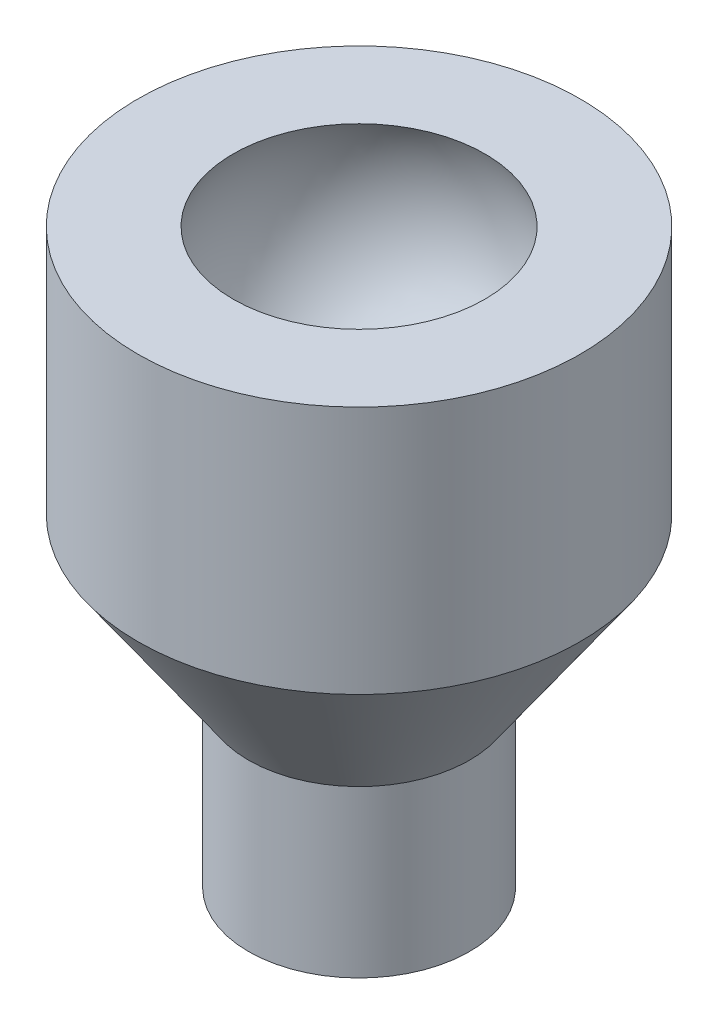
ISO-10303-21;
HEADER;
FILE_DESCRIPTION(('STEP AP214'),'2;1');
FILE_NAME('part.step','',(''),(''),'','','');
FILE_SCHEMA(('AUTOMOTIVE_DESIGN { 1 0 10303 214 1 1 1 1 }'));
ENDSEC;
DATA;
#1=APPLICATION_CONTEXT('core data for automotive mechanical design processes');
#2=APPLICATION_PROTOCOL_DEFINITION('international standard','automotive_design',2000,#1);
#3=PRODUCT_CONTEXT('',#1,'mechanical');
#4=PRODUCT('Part','Part','',(#3));
#5=PRODUCT_RELATED_PRODUCT_CATEGORY('part','',(#4));
#6=PRODUCT_DEFINITION_FORMATION('','',#4);
#7=PRODUCT_DEFINITION_CONTEXT('part definition',#1,'design');
#8=PRODUCT_DEFINITION('design','',#6,#7);
#9=PRODUCT_DEFINITION_SHAPE('','',#8);
#10=(LENGTH_UNIT() NAMED_UNIT(*) SI_UNIT(.MILLI.,.METRE.));
#11=(NAMED_UNIT(*) PLANE_ANGLE_UNIT() SI_UNIT($,.RADIAN.));
#12=(NAMED_UNIT(*) SI_UNIT($,.STERADIAN.) SOLID_ANGLE_UNIT());
#13=UNCERTAINTY_MEASURE_WITH_UNIT(LENGTH_MEASURE(1.E-05),#10,'distance_accuracy_value','');
#14=(GEOMETRIC_REPRESENTATION_CONTEXT(3) GLOBAL_UNCERTAINTY_ASSIGNED_CONTEXT((#13)) GLOBAL_UNIT_ASSIGNED_CONTEXT((#10,
#11,#12)) REPRESENTATION_CONTEXT('',''));
#15=CARTESIAN_POINT('',(0.,0.,0.));
#16=DIRECTION('',(0.,0.,1.));
#17=DIRECTION('',(1.,0.,0.));
#18=AXIS2_PLACEMENT_3D('',#15,#16,#17);
#19=CARTESIAN_POINT('',(0.,6.,0.));
#20=DIRECTION('',(0.,-1.,0.));
#21=DIRECTION('',(0.,0.,-1.));
#22=AXIS2_PLACEMENT_3D('',#19,#20,#21);
#23=CYLINDRICAL_SURFACE('',#22,1.13);
#24=CARTESIAN_POINT('',(0.,0.,0.));
#25=DIRECTION('',(0.,1.,0.));
#26=DIRECTION('',(0.,0.,1.));
#27=AXIS2_PLACEMENT_3D('',#24,#25,#26);
#28=CIRCLE('',#27,1.13);
#29=CARTESIAN_POINT('',(1.13,0.,0.));
#30=VERTEX_POINT('',#29);
#31=EDGE_CURVE('E149',#30,#30,#28,.T.);
#32=ORIENTED_EDGE('',*,*,#31,.F.);
#33=CARTESIAN_POINT('',(1.13,0.,0.));
#34=CARTESIAN_POINT('',(1.13,0.0529166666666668,-0.652405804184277));
#35=CARTESIAN_POINT('',(0.565,0.105833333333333,-0.978608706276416));
#36=CARTESIAN_POINT('',(0.,0.15875,-1.30481160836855));
#37=CARTESIAN_POINT('',(-0.565,0.211666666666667,-0.978608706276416));
#38=CARTESIAN_POINT('',(-1.13,0.264583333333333,-0.652405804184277));
#39=CARTESIAN_POINT('',(-1.13,0.3175,0.));
#40=CARTESIAN_POINT('',(-1.13,0.370416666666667,0.652405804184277));
#41=CARTESIAN_POINT('',(-0.565000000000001,0.423333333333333,0.978608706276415));
#42=CARTESIAN_POINT('',(0.,0.47625,1.30481160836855));
#43=CARTESIAN_POINT('',(0.564999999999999,0.529166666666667,0.978608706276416));
#44=CARTESIAN_POINT('',(1.13,0.582083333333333,0.652405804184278));
#45=CARTESIAN_POINT('',(1.13,0.635,0.));
#46=CARTESIAN_POINT('',(1.13,0.687916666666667,-0.652405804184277));
#47=CARTESIAN_POINT('',(0.565,0.740833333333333,-0.978608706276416));
#48=CARTESIAN_POINT('',(0.,0.79375,-1.30481160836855));
#49=CARTESIAN_POINT('',(-0.565,0.846666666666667,-0.978608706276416));
#50=CARTESIAN_POINT('',(-1.13,0.899583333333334,-0.652405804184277));
#51=CARTESIAN_POINT('',(-1.13,0.9525,0.));
#52=CARTESIAN_POINT('',(-1.13,1.00541666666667,0.652405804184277));
#53=CARTESIAN_POINT('',(-0.565000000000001,1.05833333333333,0.978608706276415));
#54=CARTESIAN_POINT('',(0.,1.11125,1.30481160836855));
#55=CARTESIAN_POINT('',(0.564999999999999,1.16416666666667,0.978608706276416));
#56=CARTESIAN_POINT('',(1.13,1.21708333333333,0.652405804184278));
#57=CARTESIAN_POINT('',(1.13,1.27,0.));
#58=CARTESIAN_POINT('',(1.13,1.32291666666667,-0.652405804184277));
#59=CARTESIAN_POINT('',(0.565,1.37583333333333,-0.978608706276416));
#60=CARTESIAN_POINT('',(0.,1.42875,-1.30481160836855));
#61=CARTESIAN_POINT('',(-0.565,1.48166666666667,-0.978608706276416));
#62=CARTESIAN_POINT('',(-1.13,1.53458333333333,-0.652405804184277));
#63=CARTESIAN_POINT('',(-1.13,1.5875,0.));
#64=CARTESIAN_POINT('',(-1.13,1.64041666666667,0.652405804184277));
#65=CARTESIAN_POINT('',(-0.565000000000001,1.69333333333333,0.978608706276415));
#66=CARTESIAN_POINT('',(0.,1.74625,1.30481160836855));
#67=CARTESIAN_POINT('',(0.564999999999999,1.79916666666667,0.978608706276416));
#68=CARTESIAN_POINT('',(1.13,1.85208333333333,0.652405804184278));
#69=CARTESIAN_POINT('',(1.13,1.905,0.));
#70=CARTESIAN_POINT('',(1.13,1.95791666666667,-0.652405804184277));
#71=CARTESIAN_POINT('',(0.565,2.01083333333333,-0.978608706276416));
#72=CARTESIAN_POINT('',(0.,2.06375,-1.30481160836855));
#73=CARTESIAN_POINT('',(-0.565,2.11666666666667,-0.978608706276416));
#74=CARTESIAN_POINT('',(-1.13,2.16958333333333,-0.652405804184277));
#75=CARTESIAN_POINT('',(-1.13,2.2225,0.));
#76=CARTESIAN_POINT('',(-1.13,2.27541666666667,0.652405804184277));
#77=CARTESIAN_POINT('',(-0.565000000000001,2.32833333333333,0.978608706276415));
#78=CARTESIAN_POINT('',(0.,2.38125,1.30481160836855));
#79=CARTESIAN_POINT('',(0.564999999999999,2.43416666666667,0.978608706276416));
#80=CARTESIAN_POINT('',(1.13,2.48708333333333,0.652405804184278));
#81=CARTESIAN_POINT('',(1.13,2.54,0.));
#82=CARTESIAN_POINT('',(1.13,2.59291666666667,-0.652405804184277));
#83=CARTESIAN_POINT('',(0.565,2.64583333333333,-0.978608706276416));
#84=CARTESIAN_POINT('',(0.,2.69875,-1.30481160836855));
#85=CARTESIAN_POINT('',(-0.565,2.75166666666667,-0.978608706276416));
#86=CARTESIAN_POINT('',(-1.13,2.80458333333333,-0.652405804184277));
#87=CARTESIAN_POINT('',(-1.13,2.8575,0.));
#88=CARTESIAN_POINT('',(-1.13,2.91041666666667,0.652405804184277));
#89=CARTESIAN_POINT('',(-0.565000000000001,2.96333333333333,0.978608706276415));
#90=CARTESIAN_POINT('',(0.,3.01625,1.30481160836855));
#91=CARTESIAN_POINT('',(0.564999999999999,3.06916666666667,0.978608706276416));
#92=CARTESIAN_POINT('',(1.13,3.12208333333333,0.652405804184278));
#93=CARTESIAN_POINT('',(1.13,3.175,0.));
#94=CARTESIAN_POINT('',(1.13,3.22791666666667,-0.652405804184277));
#95=CARTESIAN_POINT('',(0.565,3.28083333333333,-0.978608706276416));
#96=CARTESIAN_POINT('',(0.,3.33375,-1.30481160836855));
#97=CARTESIAN_POINT('',(-0.565,3.38666666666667,-0.978608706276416));
#98=CARTESIAN_POINT('',(-1.13,3.43958333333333,-0.652405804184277));
#99=CARTESIAN_POINT('',(-1.13,3.4925,0.));
#100=CARTESIAN_POINT('',(-1.13,3.54541666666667,0.652405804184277));
#101=CARTESIAN_POINT('',(-0.565000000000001,3.59833333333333,0.978608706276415));
#102=CARTESIAN_POINT('',(0.,3.65125,1.30481160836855));
#103=CARTESIAN_POINT('',(0.564999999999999,3.70416666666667,0.978608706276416));
#104=CARTESIAN_POINT('',(1.13,3.75708333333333,0.652405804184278));
#105=CARTESIAN_POINT('',(1.13,3.81,0.));
#106=CARTESIAN_POINT('',(1.13,3.86291666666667,-0.652405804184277));
#107=CARTESIAN_POINT('',(0.565,3.91583333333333,-0.978608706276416));
#108=CARTESIAN_POINT('',(0.,3.96875,-1.30481160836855));
#109=CARTESIAN_POINT('',(-0.565,4.02166666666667,-0.978608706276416));
#110=CARTESIAN_POINT('',(-1.13,4.07458333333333,-0.652405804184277));
#111=CARTESIAN_POINT('',(-1.13,4.1275,0.));
#112=CARTESIAN_POINT('',(-1.13,4.18041666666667,0.652405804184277));
#113=CARTESIAN_POINT('',(-0.565000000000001,4.23333333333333,0.978608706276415));
#114=CARTESIAN_POINT('',(0.,4.28625,1.30481160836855));
#115=CARTESIAN_POINT('',(0.564999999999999,4.33916666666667,0.978608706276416));
#116=CARTESIAN_POINT('',(1.13,4.39208333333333,0.652405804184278));
#117=CARTESIAN_POINT('',(1.13,4.445,0.));
#118=CARTESIAN_POINT('',(1.13,4.49791666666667,-0.652405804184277));
#119=CARTESIAN_POINT('',(0.565,4.55083333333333,-0.978608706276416));
#120=CARTESIAN_POINT('',(0.,4.60375,-1.30481160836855));
#121=CARTESIAN_POINT('',(-0.565,4.65666666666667,-0.978608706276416));
#122=CARTESIAN_POINT('',(-1.13,4.70958333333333,-0.652405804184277));
#123=CARTESIAN_POINT('',(-1.13,4.7625,0.));
#124=CARTESIAN_POINT('',(-1.13,4.81541666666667,0.652405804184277));
#125=CARTESIAN_POINT('',(-0.565000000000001,4.86833333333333,0.978608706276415));
#126=CARTESIAN_POINT('',(0.,4.92125,1.30481160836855));
#127=CARTESIAN_POINT('',(0.564999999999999,4.97416666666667,0.978608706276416));
#128=CARTESIAN_POINT('',(1.13,5.02708333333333,0.652405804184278));
#129=CARTESIAN_POINT('',(1.13,5.08,0.));
#130=CARTESIAN_POINT('',(1.13,5.08910570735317,-0.112263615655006));
#131=CARTESIAN_POINT('',(1.10791160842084,5.09906779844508,-0.222332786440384));
#132=(BOUNDED_CURVE() B_SPLINE_CURVE(2,(#33,#34,#35,#36,#37,#38,#39,#40,#41,#42,#43,#44,#45,#46,
#47,#48,#49,#50,#51,#52,#53,#54,#55,#56,#57,#58,#59,#60,#61,#62,#63,#64,#65,#66,#67,#68,#69,#70,
#71,#72,#73,#74,#75,#76,#77,#78,#79,#80,#81,#82,#83,#84,#85,#86,#87,#88,#89,#90,#91,#92,#93,#94,
#95,#96,#97,#98,#99,#100,#101,#102,#103,#104,#105,#106,#107,#108,#109,#110,#111,#112,#113,#114,
#115,#116,#117,#118,#119,#120,#121,#122,#123,#124,#125,#126,#127,#128,#129,#130,#131),
.UNSPECIFIED.,.F.,.F.) B_SPLINE_CURVE_WITH_KNOTS((3,2,2,2,2,2,2,2,2,2,2,2,2,2,2,2,2,2,2,2,2,2,2,
2,2,2,2,2,2,2,2,2,2,2,2,2,2,2,2,2,2,2,2,2,2,2,2,2,2,3),(0.,0.0185185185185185,0.037037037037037,
0.0555555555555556,0.0740740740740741,0.0925925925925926,0.111111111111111,0.12962962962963,
0.148148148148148,0.166666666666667,0.185185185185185,0.203703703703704,0.222222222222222,
0.240740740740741,0.259259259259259,0.277777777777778,0.296296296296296,0.314814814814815,
0.333333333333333,0.351851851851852,0.37037037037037,0.388888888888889,0.407407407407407,
0.425925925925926,0.444444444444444,0.462962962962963,0.481481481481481,0.5,0.518518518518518,
0.537037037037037,0.555555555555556,0.574074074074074,0.592592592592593,0.611111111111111,
0.62962962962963,0.648148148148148,0.666666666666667,0.685185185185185,0.703703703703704,
0.722222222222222,0.740740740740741,0.759259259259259,0.777777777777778,0.796296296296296,
0.814814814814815,0.833333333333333,0.851851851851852,0.87037037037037,0.888888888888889,
0.892473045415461),
.UNSPECIFIED.) CURVE() GEOMETRIC_REPRESENTATION_ITEM() RATIONAL_B_SPLINE_CURVE((1.,
0.866025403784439,1.,0.866025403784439,1.,0.866025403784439,1.,0.866025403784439,1.,
0.866025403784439,1.,0.866025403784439,1.,0.866025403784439,1.,0.866025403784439,1.,
0.866025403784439,1.,0.866025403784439,1.,0.866025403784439,1.,0.866025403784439,1.,
0.866025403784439,1.,0.866025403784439,1.,0.866025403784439,1.,0.866025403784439,1.,
0.866025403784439,1.,0.866025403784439,1.,0.866025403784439,1.,0.866025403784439,1.,
0.866025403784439,1.,0.866025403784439,1.,0.866025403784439,1.,0.866025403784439,1.,
0.866025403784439,1.,0.866025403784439,1.,0.866025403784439,1.,0.866025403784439,1.,
0.866025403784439,1.,0.866025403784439,1.,0.866025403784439,1.,0.866025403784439,1.,
0.866025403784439,1.,0.866025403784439,1.,0.866025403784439,1.,0.866025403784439,1.,
0.866025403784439,1.,0.866025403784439,1.,0.866025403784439,1.,0.866025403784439,1.,
0.866025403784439,1.,0.866025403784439,1.,0.866025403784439,1.,0.866025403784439,1.,
0.866025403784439,1.,0.866025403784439,1.,0.866025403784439,1.,0.866025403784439,1.,
0.974069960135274,0.958177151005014)) REPRESENTATION_ITEM(''));
#133=CARTESIAN_POINT('',(1.10716516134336,5.09950856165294,-0.222137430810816));
#134=VERTEX_POINT('',#133);
#135=EDGE_CURVE('E90',#30,#134,#132,.T.);
#136=ORIENTED_EDGE('',*,*,#135,.T.);
#137=CARTESIAN_POINT('',(0.,5.1,0.));
#138=DIRECTION('',(0.,1.,0.));
#139=DIRECTION('',(0.,0.,1.));
#140=AXIS2_PLACEMENT_3D('',#137,#138,#139);
#141=CIRCLE('',#140,1.13);
#142=CARTESIAN_POINT('',(0.631256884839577,5.1,-0.937237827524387));
#143=VERTEX_POINT('',#142);
#144=EDGE_CURVE('E144',#134,#143,#141,.T.);
#145=ORIENTED_EDGE('',*,*,#144,.T.);
#146=CARTESIAN_POINT('',(1.13,0.555624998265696,0.));
#147=CARTESIAN_POINT('',(1.13,0.608541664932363,-0.652405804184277));
#148=CARTESIAN_POINT('',(0.565,0.66145833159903,-0.978608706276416));
#149=CARTESIAN_POINT('',(0.,0.714374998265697,-1.30481160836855));
#150=CARTESIAN_POINT('',(-0.565,0.767291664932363,-0.978608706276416));
#151=CARTESIAN_POINT('',(-1.13,0.82020833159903,-0.652405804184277));
#152=CARTESIAN_POINT('',(-1.13,0.873124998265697,0.));
#153=CARTESIAN_POINT('',(-1.13,0.926041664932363,0.652405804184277));
#154=CARTESIAN_POINT('',(-0.565000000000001,0.97895833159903,0.978608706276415));
#155=CARTESIAN_POINT('',(0.,1.0318749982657,1.30481160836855));
#156=CARTESIAN_POINT('',(0.564999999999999,1.08479166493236,0.978608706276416));
#157=CARTESIAN_POINT('',(1.13,1.13770833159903,0.652405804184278));
#158=CARTESIAN_POINT('',(1.13,1.1906249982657,0.));
#159=CARTESIAN_POINT('',(1.13,1.24354166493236,-0.652405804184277));
#160=CARTESIAN_POINT('',(0.565,1.29645833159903,-0.978608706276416));
#161=CARTESIAN_POINT('',(0.,1.3493749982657,-1.30481160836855));
#162=CARTESIAN_POINT('',(-0.565,1.40229166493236,-0.978608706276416));
#163=CARTESIAN_POINT('',(-1.13,1.45520833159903,-0.652405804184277));
#164=CARTESIAN_POINT('',(-1.13,1.5081249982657,0.));
#165=CARTESIAN_POINT('',(-1.13,1.56104166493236,0.652405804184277));
#166=CARTESIAN_POINT('',(-0.565000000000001,1.61395833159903,0.978608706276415));
#167=CARTESIAN_POINT('',(0.,1.6668749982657,1.30481160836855));
#168=CARTESIAN_POINT('',(0.564999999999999,1.71979166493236,0.978608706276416));
#169=CARTESIAN_POINT('',(1.13,1.77270833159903,0.652405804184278));
#170=CARTESIAN_POINT('',(1.13,1.8256249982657,0.));
#171=CARTESIAN_POINT('',(1.13,1.87854166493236,-0.652405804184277));
#172=CARTESIAN_POINT('',(0.565,1.93145833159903,-0.978608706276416));
#173=CARTESIAN_POINT('',(0.,1.9843749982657,-1.30481160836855));
#174=CARTESIAN_POINT('',(-0.565,2.03729166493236,-0.978608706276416));
#175=CARTESIAN_POINT('',(-1.13,2.09020833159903,-0.652405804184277));
#176=CARTESIAN_POINT('',(-1.13,2.1431249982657,0.));
#177=CARTESIAN_POINT('',(-1.13,2.19604166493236,0.652405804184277));
#178=CARTESIAN_POINT('',(-0.565000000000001,2.24895833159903,0.978608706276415));
#179=CARTESIAN_POINT('',(0.,2.3018749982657,1.30481160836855));
#180=CARTESIAN_POINT('',(0.564999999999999,2.35479166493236,0.978608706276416));
#181=CARTESIAN_POINT('',(1.13,2.40770833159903,0.652405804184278));
#182=CARTESIAN_POINT('',(1.13,2.4606249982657,0.));
#183=CARTESIAN_POINT('',(1.13,2.51354166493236,-0.652405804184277));
#184=CARTESIAN_POINT('',(0.565,2.56645833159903,-0.978608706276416));
#185=CARTESIAN_POINT('',(0.,2.6193749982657,-1.30481160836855));
#186=CARTESIAN_POINT('',(-0.565,2.67229166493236,-0.978608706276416));
#187=CARTESIAN_POINT('',(-1.13,2.72520833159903,-0.652405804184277));
#188=CARTESIAN_POINT('',(-1.13,2.7781249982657,0.));
#189=CARTESIAN_POINT('',(-1.13,2.83104166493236,0.652405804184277));
#190=CARTESIAN_POINT('',(-0.565000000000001,2.88395833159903,0.978608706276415));
#191=CARTESIAN_POINT('',(0.,2.9368749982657,1.30481160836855));
#192=CARTESIAN_POINT('',(0.564999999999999,2.98979166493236,0.978608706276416));
#193=CARTESIAN_POINT('',(1.13,3.04270833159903,0.652405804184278));
#194=CARTESIAN_POINT('',(1.13,3.0956249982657,0.));
#195=CARTESIAN_POINT('',(1.13,3.14854166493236,-0.652405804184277));
#196=CARTESIAN_POINT('',(0.565,3.20145833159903,-0.978608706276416));
#197=CARTESIAN_POINT('',(0.,3.2543749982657,-1.30481160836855));
#198=CARTESIAN_POINT('',(-0.565,3.30729166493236,-0.978608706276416));
#199=CARTESIAN_POINT('',(-1.13,3.36020833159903,-0.652405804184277));
#200=CARTESIAN_POINT('',(-1.13,3.4131249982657,0.));
#201=CARTESIAN_POINT('',(-1.13,3.46604166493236,0.652405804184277));
#202=CARTESIAN_POINT('',(-0.565000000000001,3.51895833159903,0.978608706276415));
#203=CARTESIAN_POINT('',(0.,3.5718749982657,1.30481160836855));
#204=CARTESIAN_POINT('',(0.564999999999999,3.62479166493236,0.978608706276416));
#205=CARTESIAN_POINT('',(1.13,3.67770833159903,0.652405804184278));
#206=CARTESIAN_POINT('',(1.13,3.7306249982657,0.));
#207=CARTESIAN_POINT('',(1.13,3.78354166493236,-0.652405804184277));
#208=CARTESIAN_POINT('',(0.565,3.83645833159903,-0.978608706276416));
#209=CARTESIAN_POINT('',(0.,3.8893749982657,-1.30481160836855));
#210=CARTESIAN_POINT('',(-0.565,3.94229166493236,-0.978608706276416));
#211=CARTESIAN_POINT('',(-1.13,3.99520833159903,-0.652405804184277));
#212=CARTESIAN_POINT('',(-1.13,4.0481249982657,0.));
#213=CARTESIAN_POINT('',(-1.13,4.10104166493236,0.652405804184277));
#214=CARTESIAN_POINT('',(-0.565000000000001,4.15395833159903,0.978608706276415));
#215=CARTESIAN_POINT('',(0.,4.2068749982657,1.30481160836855));
#216=CARTESIAN_POINT('',(0.564999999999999,4.25979166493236,0.978608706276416));
#217=CARTESIAN_POINT('',(1.13,4.31270833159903,0.652405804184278));
#218=CARTESIAN_POINT('',(1.13,4.3656249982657,0.));
#219=CARTESIAN_POINT('',(1.13,4.41854166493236,-0.652405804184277));
#220=CARTESIAN_POINT('',(0.565,4.47145833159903,-0.978608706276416));
#221=CARTESIAN_POINT('',(0.,4.5243749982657,-1.30481160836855));
#222=CARTESIAN_POINT('',(-0.565,4.57729166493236,-0.978608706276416));
#223=CARTESIAN_POINT('',(-1.13,4.63020833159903,-0.652405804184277));
#224=CARTESIAN_POINT('',(-1.13,4.6831249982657,0.));
#225=CARTESIAN_POINT('',(-1.13,4.73604166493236,0.652405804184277));
#226=CARTESIAN_POINT('',(-0.565000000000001,4.78895833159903,0.978608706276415));
#227=CARTESIAN_POINT('',(0.,4.8418749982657,1.30481160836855));
#228=CARTESIAN_POINT('',(0.564999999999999,4.89479166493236,0.978608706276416));
#229=CARTESIAN_POINT('',(1.13,4.94770833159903,0.652405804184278));
#230=CARTESIAN_POINT('',(1.13,5.0006249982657,0.));
#231=CARTESIAN_POINT('',(1.13,5.05354166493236,-0.652405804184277));
#232=CARTESIAN_POINT('',(0.565,5.10645833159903,-0.978608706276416));
#233=CARTESIAN_POINT('',(0.,5.1593749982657,-1.30481160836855));
#234=CARTESIAN_POINT('',(-0.565,5.21229166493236,-0.978608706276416));
#235=CARTESIAN_POINT('',(-1.13,5.26520833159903,-0.652405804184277));
#236=CARTESIAN_POINT('',(-1.13,5.3181249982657,0.));
#237=CARTESIAN_POINT('',(-1.13,5.37104166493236,0.652405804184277));
#238=CARTESIAN_POINT('',(-0.565000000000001,5.42395833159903,0.978608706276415));
#239=CARTESIAN_POINT('',(0.,5.4768749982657,1.30481160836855));
#240=CARTESIAN_POINT('',(0.564999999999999,5.52979166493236,0.978608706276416));
#241=CARTESIAN_POINT('',(1.13,5.58270833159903,0.652405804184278));
#242=CARTESIAN_POINT('',(1.13,5.6356249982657,0.));
#243=CARTESIAN_POINT('',(1.13,5.64472712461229,-0.112219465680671));
#244=CARTESIAN_POINT('',(1.10792880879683,5.65468503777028,-0.222247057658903));
#245=(BOUNDED_CURVE() B_SPLINE_CURVE(2,(#146,#147,#148,#149,#150,#151,#152,#153,#154,#155,#156,
#157,#158,#159,#160,#161,#162,#163,#164,#165,#166,#167,#168,#169,#170,#171,#172,#173,#174,#175,
#176,#177,#178,#179,#180,#181,#182,#183,#184,#185,#186,#187,#188,#189,#190,#191,#192,#193,#194,
#195,#196,#197,#198,#199,#200,#201,#202,#203,#204,#205,#206,#207,#208,#209,#210,#211,#212,#213,
#214,#215,#216,#217,#218,#219,#220,#221,#222,#223,#224,#225,#226,#227,#228,#229,#230,#231,#232,
#233,#234,#235,#236,#237,#238,#239,#240,#241,#242,#243,#244),.UNSPECIFIED.,.F.,
.F.) B_SPLINE_CURVE_WITH_KNOTS((3,2,2,2,2,2,2,2,2,2,2,2,2,2,2,2,2,2,2,2,2,2,2,2,2,2,2,2,2,2,2,2,
2,2,2,2,2,2,2,2,2,2,2,2,2,2,2,2,2,3),(0.,0.0185185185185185,0.037037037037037,
0.0555555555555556,0.0740740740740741,0.0925925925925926,0.111111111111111,0.12962962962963,
0.148148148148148,0.166666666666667,0.185185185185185,0.203703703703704,0.222222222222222,
0.240740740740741,0.259259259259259,0.277777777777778,0.296296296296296,0.314814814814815,
0.333333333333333,0.351851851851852,0.37037037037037,0.388888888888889,0.407407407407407,
0.425925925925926,0.444444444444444,0.462962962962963,0.481481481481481,0.5,0.518518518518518,
0.537037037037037,0.555555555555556,0.574074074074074,0.592592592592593,0.611111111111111,
0.62962962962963,0.648148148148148,0.666666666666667,0.685185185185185,0.703703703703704,
0.722222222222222,0.740740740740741,0.759259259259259,0.777777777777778,0.796296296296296,
0.814814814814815,0.833333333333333,0.851851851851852,0.87037037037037,0.888888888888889,
0.892471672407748),
.UNSPECIFIED.) CURVE() GEOMETRIC_REPRESENTATION_ITEM() RATIONAL_B_SPLINE_CURVE((1.,
0.866025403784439,1.,0.866025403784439,1.,0.866025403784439,1.,0.866025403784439,1.,
0.866025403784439,1.,0.866025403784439,1.,0.866025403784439,1.,0.866025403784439,1.,
0.866025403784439,1.,0.866025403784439,1.,0.866025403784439,1.,0.866025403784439,1.,
0.866025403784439,1.,0.866025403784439,1.,0.866025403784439,1.,0.866025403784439,1.,
0.866025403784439,1.,0.866025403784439,1.,0.866025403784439,1.,0.866025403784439,1.,
0.866025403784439,1.,0.866025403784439,1.,0.866025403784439,1.,0.866025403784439,1.,
0.866025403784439,1.,0.866025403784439,1.,0.866025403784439,1.,0.866025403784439,1.,
0.866025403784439,1.,0.866025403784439,1.,0.866025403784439,1.,0.866025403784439,1.,
0.866025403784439,1.,0.866025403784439,1.,0.866025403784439,1.,0.866025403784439,1.,
0.866025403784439,1.,0.866025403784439,1.,0.866025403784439,1.,0.866025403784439,1.,
0.866025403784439,1.,0.866025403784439,1.,0.866025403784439,1.,0.866025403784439,1.,
0.866025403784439,1.,0.866025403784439,1.,0.866025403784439,1.,0.866025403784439,1.,
0.974079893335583,0.958189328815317)) REPRESENTATION_ITEM(''));
#246=CARTESIAN_POINT('',(1.13,0.555624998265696,0.));
#247=VERTEX_POINT('',#246);
#248=EDGE_CURVE('E45',#247,#143,#245,.T.);
#249=ORIENTED_EDGE('',*,*,#248,.F.);
#250=CARTESIAN_POINT('',(1.13,0.,0.));
#251=CARTESIAN_POINT('',(1.13,0.555624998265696,0.));
#252=(BOUNDED_CURVE() B_SPLINE_CURVE(1,(#250,#251),.UNSPECIFIED.,.F.,
.F.) B_SPLINE_CURVE_WITH_KNOTS((2,2),(0.,1.),
.UNSPECIFIED.) CURVE() GEOMETRIC_REPRESENTATION_ITEM() RATIONAL_B_SPLINE_CURVE((1.,1.)) REPRESENTATION_ITEM(''));
#253=EDGE_CURVE('E87',#30,#247,#252,.T.);
#254=ORIENTED_EDGE('',*,*,#253,.F.);
#255=EDGE_LOOP('',(#32,#136,#145,#249,#254));
#256=FACE_BOUND('',#255,.T.);
#257=ADVANCED_FACE('F41',(#256),#23,.F.);
#258=CARTESIAN_POINT('',(0.,5.1,0.));
#259=DIRECTION('',(0.,1.,0.));
#260=DIRECTION('',(0.,0.,1.));
#261=AXIS2_PLACEMENT_3D('',#258,#259,#260);
#262=PLANE('',#261);
#263=CARTESIAN_POINT('',(-0.146269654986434,5.1,0.772571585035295));
#264=CARTESIAN_POINT('',(-0.111954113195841,5.09999999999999,0.787595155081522));
#265=CARTESIAN_POINT('',(-0.0765939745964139,5.09999999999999,0.800171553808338));
#266=CARTESIAN_POINT('',(-0.00442491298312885,5.10000000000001,0.820289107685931));
#267=CARTESIAN_POINT('',(0.0323856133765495,5.10000000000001,0.82782451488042));
#268=CARTESIAN_POINT('',(0.114244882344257,5.09999999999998,0.838680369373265));
#269=CARTESIAN_POINT('',(0.159455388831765,5.09999999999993,0.840841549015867));
#270=CARTESIAN_POINT('',(0.226997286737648,5.10000000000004,0.838435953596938));
#271=CARTESIAN_POINT('',(0.249467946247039,5.1000000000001,0.836692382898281));
#272=CARTESIAN_POINT('',(0.294188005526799,5.0999999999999,0.831347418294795));
#273=CARTESIAN_POINT('',(0.316437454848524,5.09999999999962,0.82774645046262));
#274=CARTESIAN_POINT('',(0.360730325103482,5.09999999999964,0.818679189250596));
#275=CARTESIAN_POINT('',(0.382770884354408,5.09999999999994,0.813198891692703));
#276=CARTESIAN_POINT('',(0.415432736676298,5.10000000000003,0.803627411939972));
#277=CARTESIAN_POINT('',(0.426255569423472,5.10000000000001,0.800210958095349));
#278=CARTESIAN_POINT('',(0.447746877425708,5.09999999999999,0.792921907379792));
#279=CARTESIAN_POINT('',(0.458415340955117,5.10000000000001,0.789049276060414));
#280=CARTESIAN_POINT('',(0.490236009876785,5.09999999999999,0.77687884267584));
#281=CARTESIAN_POINT('',(0.511181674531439,5.09999999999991,0.768035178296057));
#282=CARTESIAN_POINT('',(0.552413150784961,5.10000000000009,0.748927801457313));
#283=CARTESIAN_POINT('',(0.572698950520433,5.10000000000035,0.738664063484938));
#284=CARTESIAN_POINT('',(0.614819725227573,5.10000000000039,0.715495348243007));
#285=CARTESIAN_POINT('',(0.636562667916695,5.10000000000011,0.702422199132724));
#286=CARTESIAN_POINT('',(0.678973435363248,5.09999999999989,0.67464618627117));
#287=CARTESIAN_POINT('',(0.699641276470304,5.09999999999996,0.659943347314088));
#288=CARTESIAN_POINT('',(0.759830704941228,5.10000000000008,0.613524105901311));
#289=CARTESIAN_POINT('',(0.797588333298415,5.10000000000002,0.579469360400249));
#290=CARTESIAN_POINT('',(0.870742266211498,5.09999999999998,0.502486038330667));
#291=CARTESIAN_POINT('',(0.905572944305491,5.1,0.459021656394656));
#292=CARTESIAN_POINT('',(0.967477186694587,5.1,0.36685202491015));
#293=CARTESIAN_POINT('',(0.994551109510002,5.09999999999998,0.318147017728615));
#294=CARTESIAN_POINT('',(1.02881524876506,5.09999999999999,0.242197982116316));
#295=CARTESIAN_POINT('',(1.03919304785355,5.1,0.216345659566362));
#296=CARTESIAN_POINT('',(1.05775018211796,5.1,0.163861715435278));
#297=CARTESIAN_POINT('',(1.06592983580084,5.1,0.137230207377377));
#298=CARTESIAN_POINT('',(1.08005223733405,5.1,0.0833674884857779));
#299=CARTESIAN_POINT('',(1.08599416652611,5.1,0.0561360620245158));
#300=CARTESIAN_POINT('',(1.09316221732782,5.1,0.0149938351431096));
#301=CARTESIAN_POINT('',(1.09526083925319,5.1,0.00122968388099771));
#302=CARTESIAN_POINT('',(1.09896206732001,5.1,-0.026365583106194));
#303=CARTESIAN_POINT('',(1.10056463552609,5.1,-0.0401967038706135));
#304=CARTESIAN_POINT('',(1.10465861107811,5.1,-0.0819894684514));
#305=CARTESIAN_POINT('',(1.1063984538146,5.1,-0.110028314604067));
#306=CARTESIAN_POINT('',(1.10786606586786,5.1,-0.166066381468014));
#307=CARTESIAN_POINT('',(1.10760041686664,5.1,-0.194065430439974));
#308=CARTESIAN_POINT('',(1.10632854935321,5.1,-0.222015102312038));
#309=B_SPLINE_CURVE_WITH_KNOTS('',3,(#263,#264,#265,#266,#267,#268,#269,#270,#271,#272,#273,
#274,#275,#276,#277,#278,#279,#280,#281,#282,#283,#284,#285,#286,#287,#288,#289,#290,#291,#292,
#293,#294,#295,#296,#297,#298,#299,#300,#301,#302,#303,#304,#305,#306,#307,#308),.UNSPECIFIED.,
.F.,.F.,(4,2,2,2,2,2,2,2,2,2,2,2,2,2,2,2,2,2,2,2,2,2,4),(0.,0.112243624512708,0.224615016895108,
0.359691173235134,0.427243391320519,0.494780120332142,0.562831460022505,0.596870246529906,
0.630911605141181,0.699062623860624,0.767214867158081,0.843246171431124,0.919276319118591,
1.07116671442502,1.23749526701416,1.40381613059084,1.48730774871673,1.57078726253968,
1.65429728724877,1.69605766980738,1.73782124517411,1.82202304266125,1.90594862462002),.UNSPECIFIED.);
#310=CARTESIAN_POINT('',(-0.146269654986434,5.1,0.772571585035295));
#311=VERTEX_POINT('',#310);
#312=EDGE_CURVE('E12',#311,#134,#309,.T.);
#313=ORIENTED_EDGE('',*,*,#312,.F.);
#314=CARTESIAN_POINT('',(-0.76995644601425,5.1,-0.159463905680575));
#315=CARTESIAN_POINT('',(-0.778964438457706,5.1,-0.116154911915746));
#316=CARTESIAN_POINT('',(-0.784243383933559,5.1,-0.0720850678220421));
#317=CARTESIAN_POINT('',(-0.787358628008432,5.1,0.0162835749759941));
#318=CARTESIAN_POINT('',(-0.785200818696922,5.1,0.0605821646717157));
#319=CARTESIAN_POINT('',(-0.773469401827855,5.1,0.148209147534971));
#320=CARTESIAN_POINT('',(-0.763892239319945,5.1,0.191537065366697));
#321=CARTESIAN_POINT('',(-0.737603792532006,5.1,0.275963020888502));
#322=CARTESIAN_POINT('',(-0.720893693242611,5.1,0.317061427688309));
#323=CARTESIAN_POINT('',(-0.680809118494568,5.1,0.395873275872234));
#324=CARTESIAN_POINT('',(-0.657434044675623,5.1,0.433586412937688));
#325=CARTESIAN_POINT('',(-0.60468377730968,5.1,0.504552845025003));
#326=CARTESIAN_POINT('',(-0.575308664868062,5.1,0.537806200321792));
#327=CARTESIAN_POINT('',(-0.511388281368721,5.1,0.598915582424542));
#328=CARTESIAN_POINT('',(-0.476841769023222,5.1,0.626770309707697));
#329=CARTESIAN_POINT('',(-0.403566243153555,5.1,0.676275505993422));
#330=CARTESIAN_POINT('',(-0.364839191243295,5.1,0.697928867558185));
#331=CARTESIAN_POINT('',(-0.29610993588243,5.1,0.729081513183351));
#332=CARTESIAN_POINT('',(-0.266865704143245,5.1,0.740283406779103));
#333=CARTESIAN_POINT('',(-0.20729051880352,5.1,0.759123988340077));
#334=CARTESIAN_POINT('',(-0.17696093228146,5.1,0.766766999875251));
#335=CARTESIAN_POINT('',(-0.146269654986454,5.10000000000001,0.772571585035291));
#336=B_SPLINE_CURVE_WITH_KNOTS('',3,(#314,#315,#316,#317,#318,#319,#320,#321,#322,#323,#324,
#325,#326,#327,#328,#329,#330,#331,#332,#333,#334,#335),.UNSPECIFIED.,.F.,.F.,(4,2,2,2,2,2,2,2,
2,2,4),(0.,0.132531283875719,0.264957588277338,0.397447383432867,0.529915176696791,
0.662394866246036,0.794872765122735,0.927382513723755,1.05983035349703,1.15356908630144,
1.24719363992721),.UNSPECIFIED.);
#337=CARTESIAN_POINT('',(-0.769956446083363,5.10000000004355,-0.159463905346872));
#338=VERTEX_POINT('',#337);
#339=EDGE_CURVE('E53',#338,#311,#336,.T.);
#340=ORIENTED_EDGE('',*,*,#339,.F.);
#341=CARTESIAN_POINT('',(0.63125688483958,5.1,-0.937237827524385));
#342=CARTESIAN_POINT('',(0.617548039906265,5.1,-0.943799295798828));
#343=CARTESIAN_POINT('',(0.603727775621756,5.1,-0.950135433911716));
#344=CARTESIAN_POINT('',(0.575853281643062,5.1,-0.962276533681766));
#345=CARTESIAN_POINT('',(0.561799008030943,5.1,-0.968081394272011));
#346=CARTESIAN_POINT('',(0.533447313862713,5.1,-0.979078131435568));
#347=CARTESIAN_POINT('',(0.519149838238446,5.1,-0.984269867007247));
#348=CARTESIAN_POINT('',(0.490339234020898,5.1,-0.994007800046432));
#349=CARTESIAN_POINT('',(0.47582611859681,5.1,-0.998554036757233));
#350=CARTESIAN_POINT('',(0.432010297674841,5.1,-1.01121477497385));
#351=CARTESIAN_POINT('',(0.402418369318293,5.1,-1.01835625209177));
#352=CARTESIAN_POINT('',(0.34273276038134,5.1,-1.02996948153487));
#353=CARTESIAN_POINT('',(0.312639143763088,5.1,-1.03444157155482));
#354=CARTESIAN_POINT('',(0.223159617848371,5.1,-1.04365675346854));
#355=CARTESIAN_POINT('',(0.163326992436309,5.1,-1.04455617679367));
#356=CARTESIAN_POINT('',(0.0445219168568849,5.1,-1.03585219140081));
#357=CARTESIAN_POINT('',(-0.0144512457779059,5.1,-1.02625805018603));
#358=CARTESIAN_POINT('',(-0.127384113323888,5.1,-0.997466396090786));
#359=CARTESIAN_POINT('',(-0.181450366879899,5.1,-0.978692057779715));
#360=CARTESIAN_POINT('',(-0.259577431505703,5.1,-0.943924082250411));
#361=CARTESIAN_POINT('',(-0.285148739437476,5.1,-0.93121748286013));
#362=CARTESIAN_POINT('',(-0.335144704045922,5.1,-0.903682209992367));
#363=CARTESIAN_POINT('',(-0.359568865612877,5.1,-0.888852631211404));
#364=CARTESIAN_POINT('',(-0.407126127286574,5.1,-0.857145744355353));
#365=CARTESIAN_POINT('',(-0.430256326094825,5.1,-0.840264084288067));
#366=CARTESIAN_POINT('',(-0.463821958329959,5.1,-0.813543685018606));
#367=CARTESIAN_POINT('',(-0.474820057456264,5.1,-0.804405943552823));
#368=CARTESIAN_POINT('',(-0.496328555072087,5.1,-0.785574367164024));
#369=CARTESIAN_POINT('',(-0.506838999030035,5.1,-0.775880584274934));
#370=CARTESIAN_POINT('',(-0.53755729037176,5.1,-0.746069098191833));
#371=CARTESIAN_POINT('',(-0.557017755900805,5.1,-0.725169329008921));
#372=CARTESIAN_POINT('',(-0.593727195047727,5.1,-0.681472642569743));
#373=CARTESIAN_POINT('',(-0.610972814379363,5.1,-0.658672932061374));
#374=CARTESIAN_POINT('',(-0.655117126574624,5.1,-0.593610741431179));
#375=CARTESIAN_POINT('',(-0.679516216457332,5.1,-0.549611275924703));
#376=CARTESIAN_POINT('',(-0.719950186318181,5.1,-0.457973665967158));
#377=CARTESIAN_POINT('',(-0.735992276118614,5.1,-0.410338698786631));
#378=CARTESIAN_POINT('',(-0.755481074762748,5.1,-0.3285550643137));
#379=CARTESIAN_POINT('',(-0.761314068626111,5.1,-0.294957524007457));
#380=CARTESIAN_POINT('',(-0.768781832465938,5.1,-0.22738963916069));
#381=CARTESIAN_POINT('',(-0.770427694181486,5.1,-0.193420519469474));
#382=CARTESIAN_POINT('',(-0.76995644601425,5.1,-0.159463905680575));
#383=B_SPLINE_CURVE_WITH_KNOTS('',3,(#341,#342,#343,#344,#345,#346,#347,#348,#349,#350,#351,
#352,#353,#354,#355,#356,#357,#358,#359,#360,#361,#362,#363,#364,#365,#366,#367,#368,#369,#370,
#371,#372,#373,#374,#375,#376,#377,#378,#379,#380,#381,#382),.UNSPECIFIED.,.F.,.F.,(4,2,2,2,2,2,
2,2,2,2,2,2,2,2,2,2,2,2,2,2,4),(0.,0.0455973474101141,0.0912033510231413,0.13681982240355,
0.182433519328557,0.273620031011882,0.364795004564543,0.543304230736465,0.721655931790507,
0.892467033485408,0.97804576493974,1.06366109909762,1.14946127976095,1.19234355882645,
1.23522183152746,1.3207283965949,1.406362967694,1.55642757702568,1.70636250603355,
1.80841613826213,1.91019914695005),.UNSPECIFIED.);
#384=EDGE_CURVE('E97',#143,#338,#383,.T.);
#385=ORIENTED_EDGE('',*,*,#384,.F.);
#386=ORIENTED_EDGE('',*,*,#144,.F.);
#387=EDGE_LOOP('',(#313,#340,#385,#386));
#388=FACE_BOUND('',#387,.T.);
#389=ADVANCED_FACE('F165',(#388),#262,.F.);
#390=CARTESIAN_POINT('',(0.,2.84018337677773,0.));
#391=DIRECTION('',(0.,1.,0.));
#392=DIRECTION('',(0.,0.,1.));
#393=AXIS2_PLACEMENT_3D('',#390,#391,#392);
#394=CONICAL_SURFACE('',#393,1.8900567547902,0.610865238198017);
#395=CARTESIAN_POINT('',(0.,5.85349461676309,0.));
#396=DIRECTION('',(0.,1.,0.));
#397=DIRECTION('',(0.,0.,1.));
#398=AXIS2_PLACEMENT_3D('',#395,#396,#397);
#399=CIRCLE('',#398,4.);
#400=CARTESIAN_POINT('',(0.,5.85349461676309,4.));
#401=VERTEX_POINT('',#400);
#402=EDGE_CURVE('E141',#401,#401,#399,.T.);
#403=ORIENTED_EDGE('',*,*,#402,.F.);
#404=EDGE_LOOP('',(#403));
#405=FACE_BOUND('',#404,.T.);
#406=CARTESIAN_POINT('',(0.,2.99719860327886,0.));
#407=DIRECTION('',(0.,1.,0.));
#408=DIRECTION('',(0.,0.,1.));
#409=AXIS2_PLACEMENT_3D('',#406,#407,#408);
#410=CIRCLE('',#409,2.);
#411=CARTESIAN_POINT('',(0.,2.99719860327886,2.));
#412=VERTEX_POINT('',#411);
#413=EDGE_CURVE('E148',#412,#412,#410,.T.);
#414=ORIENTED_EDGE('',*,*,#413,.T.);
#415=EDGE_LOOP('',(#414));
#416=FACE_BOUND('',#415,.T.);
#417=ADVANCED_FACE('F251',(#405,#416),#394,.T.);
#418=CARTESIAN_POINT('',(0.,9.1,0.));
#419=DIRECTION('',(0.,1.,0.));
#420=DIRECTION('',(0.,0.,1.));
#421=AXIS2_PLACEMENT_3D('',#418,#419,#420);
#422=CYLINDRICAL_SURFACE('',#421,4.);
#423=CARTESIAN_POINT('',(0.,10.354991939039,0.));
#424=DIRECTION('',(0.,1.,0.));
#425=DIRECTION('',(0.,0.,1.));
#426=AXIS2_PLACEMENT_3D('',#423,#424,#425);
#427=CIRCLE('',#426,4.);
#428=CARTESIAN_POINT('',(0.,10.354991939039,4.));
#429=VERTEX_POINT('',#428);
#430=EDGE_CURVE('E138',#429,#429,#427,.T.);
#431=ORIENTED_EDGE('',*,*,#430,.F.);
#432=EDGE_LOOP('',(#431));
#433=FACE_BOUND('',#432,.T.);
#434=ORIENTED_EDGE('',*,*,#402,.T.);
#435=EDGE_LOOP('',(#434));
#436=FACE_BOUND('',#435,.T.);
#437=ADVANCED_FACE('F248',(#433,#436),#422,.T.);
#438=CARTESIAN_POINT('',(2.27705846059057,10.354991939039,0.));
#439=DIRECTION('',(0.,-1.,0.));
#440=DIRECTION('',(0.,0.,-1.));
#441=AXIS2_PLACEMENT_3D('',#438,#439,#440);
#442=PLANE('',#441);
#443=CARTESIAN_POINT('',(0.,10.354991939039,0.));
#444=DIRECTION('',(0.,1.,0.));
#445=DIRECTION('',(0.,0.,1.));
#446=AXIS2_PLACEMENT_3D('',#443,#444,#445);
#447=CIRCLE('',#446,2.27705846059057);
#448=CARTESIAN_POINT('',(0.,10.354991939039,2.27705846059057));
#449=VERTEX_POINT('',#448);
#450=EDGE_CURVE('E132',#449,#449,#447,.T.);
#451=ORIENTED_EDGE('',*,*,#450,.F.);
#452=EDGE_LOOP('',(#451));
#453=FACE_BOUND('',#452,.T.);
#454=ORIENTED_EDGE('',*,*,#430,.T.);
#455=EDGE_LOOP('',(#454));
#456=FACE_BOUND('',#455,.T.);
#457=ADVANCED_FACE('F244',(#453,#456),#442,.F.);
#458=CARTESIAN_POINT('',(0.,9.1,0.));
#459=DIRECTION('',(0.,1.,0.));
#460=DIRECTION('',(1.,0.,0.));
#461=AXIS2_PLACEMENT_3D('',#458,#459,#460);
#462=SPHERICAL_SURFACE('',#461,2.6);
#463=ORIENTED_EDGE('',*,*,#450,.T.);
#464=EDGE_LOOP('',(#463));
#465=FACE_BOUND('',#464,.T.);
#466=ADVANCED_FACE('F241',(#465),#462,.F.);
#467=CARTESIAN_POINT('',(0.,6.,0.));
#468=DIRECTION('',(0.,-1.,0.));
#469=DIRECTION('',(0.,0.,-1.));
#470=AXIS2_PLACEMENT_3D('',#467,#468,#469);
#471=CYLINDRICAL_SURFACE('',#470,2.);
#472=CARTESIAN_POINT('',(0.,0.,0.));
#473=DIRECTION('',(0.,1.,0.));
#474=DIRECTION('',(0.,0.,1.));
#475=AXIS2_PLACEMENT_3D('',#472,#473,#474);
#476=CIRCLE('',#475,2.);
#477=CARTESIAN_POINT('',(0.,0.,2.));
#478=VERTEX_POINT('',#477);
#479=EDGE_CURVE('E145',#478,#478,#476,.T.);
#480=ORIENTED_EDGE('',*,*,#479,.T.);
#481=EDGE_LOOP('',(#480));
#482=FACE_BOUND('',#481,.T.);
#483=ORIENTED_EDGE('',*,*,#413,.F.);
#484=EDGE_LOOP('',(#483));
#485=FACE_BOUND('',#484,.T.);
#486=ADVANCED_FACE('F43',(#482,#485),#471,.T.);
#487=CARTESIAN_POINT('',(0.,0.,0.));
#488=DIRECTION('',(0.,1.,0.));
#489=DIRECTION('',(0.,0.,1.));
#490=AXIS2_PLACEMENT_3D('',#487,#488,#489);
#491=PLANE('',#490);
#492=ORIENTED_EDGE('',*,*,#479,.F.);
#493=EDGE_LOOP('',(#492));
#494=FACE_BOUND('',#493,.T.);
#495=ORIENTED_EDGE('',*,*,#31,.T.);
#496=EDGE_LOOP('',(#495));
#497=FACE_BOUND('',#496,.T.);
#498=ADVANCED_FACE('F231',(#494,#497),#491,.F.);
#499=CARTESIAN_POINT('',(0.786296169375,0.198437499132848,0.));
#500=CARTESIAN_POINT('',(0.786296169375,0.251354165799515,-0.453968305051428));
#501=CARTESIAN_POINT('',(0.3931480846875,0.304270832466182,-0.680952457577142));
#502=CARTESIAN_POINT('',(0.,0.357187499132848,-0.907936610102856));
#503=CARTESIAN_POINT('',(-0.3931480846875,0.410104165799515,-0.680952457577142));
#504=CARTESIAN_POINT('',(-0.786296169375,0.463020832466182,-0.453968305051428));
#505=CARTESIAN_POINT('',(-0.786296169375,0.515937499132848,0.));
#506=CARTESIAN_POINT('',(-0.786296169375,0.568854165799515,0.453968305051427));
#507=CARTESIAN_POINT('',(-0.3931480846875,0.621770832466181,0.680952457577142));
#508=CARTESIAN_POINT('',(0.,0.674687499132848,0.907936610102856));
#509=CARTESIAN_POINT('',(0.393148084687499,0.727604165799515,0.680952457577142));
#510=CARTESIAN_POINT('',(0.786296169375,0.780520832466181,0.453968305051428));
#511=CARTESIAN_POINT('',(0.786296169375,0.833437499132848,0.));
#512=CARTESIAN_POINT('',(0.786296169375,0.886354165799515,-0.453968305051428));
#513=CARTESIAN_POINT('',(0.3931480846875,0.939270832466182,-0.680952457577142));
#514=CARTESIAN_POINT('',(0.,0.992187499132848,-0.907936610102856));
#515=CARTESIAN_POINT('',(-0.3931480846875,1.04510416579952,-0.680952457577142));
#516=CARTESIAN_POINT('',(-0.786296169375,1.09802083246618,-0.453968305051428));
#517=CARTESIAN_POINT('',(-0.786296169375,1.15093749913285,0.));
#518=CARTESIAN_POINT('',(-0.786296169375,1.20385416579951,0.453968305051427));
#519=CARTESIAN_POINT('',(-0.3931480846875,1.25677083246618,0.680952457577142));
#520=CARTESIAN_POINT('',(0.,1.30968749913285,0.907936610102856));
#521=CARTESIAN_POINT('',(0.393148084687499,1.36260416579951,0.680952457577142));
#522=CARTESIAN_POINT('',(0.786296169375,1.41552083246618,0.453968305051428));
#523=CARTESIAN_POINT('',(0.786296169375,1.46843749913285,0.));
#524=CARTESIAN_POINT('',(0.786296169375,1.52135416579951,-0.453968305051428));
#525=CARTESIAN_POINT('',(0.3931480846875,1.57427083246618,-0.680952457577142));
#526=CARTESIAN_POINT('',(0.,1.62718749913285,-0.907936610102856));
#527=CARTESIAN_POINT('',(-0.3931480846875,1.68010416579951,-0.680952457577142));
#528=CARTESIAN_POINT('',(-0.786296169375,1.73302083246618,-0.453968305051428));
#529=CARTESIAN_POINT('',(-0.786296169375,1.78593749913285,0.));
#530=CARTESIAN_POINT('',(-0.786296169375,1.83885416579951,0.453968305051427));
#531=CARTESIAN_POINT('',(-0.3931480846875,1.89177083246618,0.680952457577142));
#532=CARTESIAN_POINT('',(0.,1.94468749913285,0.907936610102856));
#533=CARTESIAN_POINT('',(0.393148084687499,1.99760416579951,0.680952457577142));
#534=CARTESIAN_POINT('',(0.786296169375,2.05052083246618,0.453968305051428));
#535=CARTESIAN_POINT('',(0.786296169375,2.10343749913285,0.));
#536=CARTESIAN_POINT('',(0.786296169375,2.15635416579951,-0.453968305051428));
#537=CARTESIAN_POINT('',(0.3931480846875,2.20927083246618,-0.680952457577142));
#538=CARTESIAN_POINT('',(0.,2.26218749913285,-0.907936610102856));
#539=CARTESIAN_POINT('',(-0.3931480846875,2.31510416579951,-0.680952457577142));
#540=CARTESIAN_POINT('',(-0.786296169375,2.36802083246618,-0.453968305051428));
#541=CARTESIAN_POINT('',(-0.786296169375,2.42093749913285,0.));
#542=CARTESIAN_POINT('',(-0.786296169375,2.47385416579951,0.453968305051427));
#543=CARTESIAN_POINT('',(-0.3931480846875,2.52677083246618,0.680952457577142));
#544=CARTESIAN_POINT('',(0.,2.57968749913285,0.907936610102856));
#545=CARTESIAN_POINT('',(0.393148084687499,2.63260416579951,0.680952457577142));
#546=CARTESIAN_POINT('',(0.786296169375,2.68552083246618,0.453968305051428));
#547=CARTESIAN_POINT('',(0.786296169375,2.73843749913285,0.));
#548=CARTESIAN_POINT('',(0.786296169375,2.79135416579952,-0.453968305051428));
#549=CARTESIAN_POINT('',(0.3931480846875,2.84427083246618,-0.680952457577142));
#550=CARTESIAN_POINT('',(0.,2.89718749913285,-0.907936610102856));
#551=CARTESIAN_POINT('',(-0.3931480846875,2.95010416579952,-0.680952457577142));
#552=CARTESIAN_POINT('',(-0.786296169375,3.00302083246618,-0.453968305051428));
#553=CARTESIAN_POINT('',(-0.786296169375,3.05593749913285,0.));
#554=CARTESIAN_POINT('',(-0.786296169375,3.10885416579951,0.453968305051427));
#555=CARTESIAN_POINT('',(-0.3931480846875,3.16177083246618,0.680952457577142));
#556=CARTESIAN_POINT('',(0.,3.21468749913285,0.907936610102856));
#557=CARTESIAN_POINT('',(0.393148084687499,3.26760416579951,0.680952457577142));
#558=CARTESIAN_POINT('',(0.786296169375,3.32052083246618,0.453968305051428));
#559=CARTESIAN_POINT('',(0.786296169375,3.37343749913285,0.));
#560=CARTESIAN_POINT('',(0.786296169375,3.42635416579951,-0.453968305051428));
#561=CARTESIAN_POINT('',(0.3931480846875,3.47927083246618,-0.680952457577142));
#562=CARTESIAN_POINT('',(0.,3.53218749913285,-0.907936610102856));
#563=CARTESIAN_POINT('',(-0.3931480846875,3.58510416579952,-0.680952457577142));
#564=CARTESIAN_POINT('',(-0.786296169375,3.63802083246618,-0.453968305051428));
#565=CARTESIAN_POINT('',(-0.786296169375,3.69093749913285,0.));
#566=CARTESIAN_POINT('',(-0.786296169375,3.74385416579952,0.453968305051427));
#567=CARTESIAN_POINT('',(-0.3931480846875,3.79677083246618,0.680952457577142));
#568=CARTESIAN_POINT('',(0.,3.84968749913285,0.907936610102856));
#569=CARTESIAN_POINT('',(0.393148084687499,3.90260416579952,0.680952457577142));
#570=CARTESIAN_POINT('',(0.786296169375,3.95552083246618,0.453968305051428));
#571=CARTESIAN_POINT('',(0.786296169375,4.00843749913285,0.));
#572=CARTESIAN_POINT('',(0.786296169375,4.06135416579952,-0.453968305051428));
#573=CARTESIAN_POINT('',(0.3931480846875,4.11427083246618,-0.680952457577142));
#574=CARTESIAN_POINT('',(0.,4.16718749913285,-0.907936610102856));
#575=CARTESIAN_POINT('',(-0.3931480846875,4.22010416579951,-0.680952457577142));
#576=CARTESIAN_POINT('',(-0.786296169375,4.27302083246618,-0.453968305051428));
#577=CARTESIAN_POINT('',(-0.786296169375,4.32593749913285,0.));
#578=CARTESIAN_POINT('',(-0.786296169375,4.37885416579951,0.453968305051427));
#579=CARTESIAN_POINT('',(-0.3931480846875,4.43177083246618,0.680952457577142));
#580=CARTESIAN_POINT('',(0.,4.48468749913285,0.907936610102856));
#581=CARTESIAN_POINT('',(0.393148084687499,4.53760416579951,0.680952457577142));
#582=CARTESIAN_POINT('',(0.786296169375,4.59052083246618,0.453968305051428));
#583=CARTESIAN_POINT('',(0.786296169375,4.64343749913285,0.));
#584=CARTESIAN_POINT('',(0.786296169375,4.69635416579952,-0.453968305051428));
#585=CARTESIAN_POINT('',(0.3931480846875,4.74927083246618,-0.680952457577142));
#586=CARTESIAN_POINT('',(0.,4.80218749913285,-0.907936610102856));
#587=CARTESIAN_POINT('',(-0.3931480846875,4.85510416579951,-0.680952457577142));
#588=CARTESIAN_POINT('',(-0.786296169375,4.90802083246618,-0.453968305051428));
#589=CARTESIAN_POINT('',(-0.786296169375,4.96093749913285,0.));
#590=CARTESIAN_POINT('',(-0.786296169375,5.01385416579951,0.453968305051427));
#591=CARTESIAN_POINT('',(-0.3931480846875,5.06677083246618,0.680952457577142));
#592=CARTESIAN_POINT('',(0.,5.11968749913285,0.907936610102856));
#593=CARTESIAN_POINT('',(0.393148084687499,5.17260416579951,0.680952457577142));
#594=CARTESIAN_POINT('',(0.786296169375,5.22552083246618,0.453968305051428));
#595=CARTESIAN_POINT('',(0.786296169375,5.27843749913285,0.));
#596=CARTESIAN_POINT('',(0.786296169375,5.28754320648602,-0.0781172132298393));
#597=CARTESIAN_POINT('',(0.77092624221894,5.29750529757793,-0.15470744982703));
#598=CARTESIAN_POINT('',(1.13,0.,0.));
#599=CARTESIAN_POINT('',(1.13,0.0529166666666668,-0.652405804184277));
#600=CARTESIAN_POINT('',(0.565,0.105833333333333,-0.978608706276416));
#601=CARTESIAN_POINT('',(0.,0.15875,-1.30481160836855));
#602=CARTESIAN_POINT('',(-0.565,0.211666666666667,-0.978608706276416));
#603=CARTESIAN_POINT('',(-1.13,0.264583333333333,-0.652405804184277));
#604=CARTESIAN_POINT('',(-1.13,0.3175,0.));
#605=CARTESIAN_POINT('',(-1.13,0.370416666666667,0.652405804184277));
#606=CARTESIAN_POINT('',(-0.565000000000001,0.423333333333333,0.978608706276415));
#607=CARTESIAN_POINT('',(0.,0.47625,1.30481160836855));
#608=CARTESIAN_POINT('',(0.564999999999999,0.529166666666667,0.978608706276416));
#609=CARTESIAN_POINT('',(1.13,0.582083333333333,0.652405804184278));
#610=CARTESIAN_POINT('',(1.13,0.635,0.));
#611=CARTESIAN_POINT('',(1.13,0.687916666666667,-0.652405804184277));
#612=CARTESIAN_POINT('',(0.565,0.740833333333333,-0.978608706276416));
#613=CARTESIAN_POINT('',(0.,0.79375,-1.30481160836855));
#614=CARTESIAN_POINT('',(-0.565,0.846666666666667,-0.978608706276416));
#615=CARTESIAN_POINT('',(-1.13,0.899583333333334,-0.652405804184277));
#616=CARTESIAN_POINT('',(-1.13,0.9525,0.));
#617=CARTESIAN_POINT('',(-1.13,1.00541666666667,0.652405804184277));
#618=CARTESIAN_POINT('',(-0.565000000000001,1.05833333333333,0.978608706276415));
#619=CARTESIAN_POINT('',(0.,1.11125,1.30481160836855));
#620=CARTESIAN_POINT('',(0.564999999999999,1.16416666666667,0.978608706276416));
#621=CARTESIAN_POINT('',(1.13,1.21708333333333,0.652405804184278));
#622=CARTESIAN_POINT('',(1.13,1.27,0.));
#623=CARTESIAN_POINT('',(1.13,1.32291666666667,-0.652405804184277));
#624=CARTESIAN_POINT('',(0.565,1.37583333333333,-0.978608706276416));
#625=CARTESIAN_POINT('',(0.,1.42875,-1.30481160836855));
#626=CARTESIAN_POINT('',(-0.565,1.48166666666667,-0.978608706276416));
#627=CARTESIAN_POINT('',(-1.13,1.53458333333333,-0.652405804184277));
#628=CARTESIAN_POINT('',(-1.13,1.5875,0.));
#629=CARTESIAN_POINT('',(-1.13,1.64041666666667,0.652405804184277));
#630=CARTESIAN_POINT('',(-0.565000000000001,1.69333333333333,0.978608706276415));
#631=CARTESIAN_POINT('',(0.,1.74625,1.30481160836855));
#632=CARTESIAN_POINT('',(0.564999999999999,1.79916666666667,0.978608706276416));
#633=CARTESIAN_POINT('',(1.13,1.85208333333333,0.652405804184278));
#634=CARTESIAN_POINT('',(1.13,1.905,0.));
#635=CARTESIAN_POINT('',(1.13,1.95791666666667,-0.652405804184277));
#636=CARTESIAN_POINT('',(0.565,2.01083333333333,-0.978608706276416));
#637=CARTESIAN_POINT('',(0.,2.06375,-1.30481160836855));
#638=CARTESIAN_POINT('',(-0.565,2.11666666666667,-0.978608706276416));
#639=CARTESIAN_POINT('',(-1.13,2.16958333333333,-0.652405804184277));
#640=CARTESIAN_POINT('',(-1.13,2.2225,0.));
#641=CARTESIAN_POINT('',(-1.13,2.27541666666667,0.652405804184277));
#642=CARTESIAN_POINT('',(-0.565000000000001,2.32833333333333,0.978608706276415));
#643=CARTESIAN_POINT('',(0.,2.38125,1.30481160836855));
#644=CARTESIAN_POINT('',(0.564999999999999,2.43416666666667,0.978608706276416));
#645=CARTESIAN_POINT('',(1.13,2.48708333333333,0.652405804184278));
#646=CARTESIAN_POINT('',(1.13,2.54,0.));
#647=CARTESIAN_POINT('',(1.13,2.59291666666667,-0.652405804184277));
#648=CARTESIAN_POINT('',(0.565,2.64583333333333,-0.978608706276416));
#649=CARTESIAN_POINT('',(0.,2.69875,-1.30481160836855));
#650=CARTESIAN_POINT('',(-0.565,2.75166666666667,-0.978608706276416));
#651=CARTESIAN_POINT('',(-1.13,2.80458333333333,-0.652405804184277));
#652=CARTESIAN_POINT('',(-1.13,2.8575,0.));
#653=CARTESIAN_POINT('',(-1.13,2.91041666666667,0.652405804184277));
#654=CARTESIAN_POINT('',(-0.565000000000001,2.96333333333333,0.978608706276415));
#655=CARTESIAN_POINT('',(0.,3.01625,1.30481160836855));
#656=CARTESIAN_POINT('',(0.564999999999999,3.06916666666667,0.978608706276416));
#657=CARTESIAN_POINT('',(1.13,3.12208333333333,0.652405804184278));
#658=CARTESIAN_POINT('',(1.13,3.175,0.));
#659=CARTESIAN_POINT('',(1.13,3.22791666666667,-0.652405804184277));
#660=CARTESIAN_POINT('',(0.565,3.28083333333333,-0.978608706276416));
#661=CARTESIAN_POINT('',(0.,3.33375,-1.30481160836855));
#662=CARTESIAN_POINT('',(-0.565,3.38666666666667,-0.978608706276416));
#663=CARTESIAN_POINT('',(-1.13,3.43958333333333,-0.652405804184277));
#664=CARTESIAN_POINT('',(-1.13,3.4925,0.));
#665=CARTESIAN_POINT('',(-1.13,3.54541666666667,0.652405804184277));
#666=CARTESIAN_POINT('',(-0.565000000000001,3.59833333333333,0.978608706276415));
#667=CARTESIAN_POINT('',(0.,3.65125,1.30481160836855));
#668=CARTESIAN_POINT('',(0.564999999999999,3.70416666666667,0.978608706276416));
#669=CARTESIAN_POINT('',(1.13,3.75708333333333,0.652405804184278));
#670=CARTESIAN_POINT('',(1.13,3.81,0.));
#671=CARTESIAN_POINT('',(1.13,3.86291666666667,-0.652405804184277));
#672=CARTESIAN_POINT('',(0.565,3.91583333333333,-0.978608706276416));
#673=CARTESIAN_POINT('',(0.,3.96875,-1.30481160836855));
#674=CARTESIAN_POINT('',(-0.565,4.02166666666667,-0.978608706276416));
#675=CARTESIAN_POINT('',(-1.13,4.07458333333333,-0.652405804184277));
#676=CARTESIAN_POINT('',(-1.13,4.1275,0.));
#677=CARTESIAN_POINT('',(-1.13,4.18041666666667,0.652405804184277));
#678=CARTESIAN_POINT('',(-0.565000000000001,4.23333333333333,0.978608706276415));
#679=CARTESIAN_POINT('',(0.,4.28625,1.30481160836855));
#680=CARTESIAN_POINT('',(0.564999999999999,4.33916666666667,0.978608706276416));
#681=CARTESIAN_POINT('',(1.13,4.39208333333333,0.652405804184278));
#682=CARTESIAN_POINT('',(1.13,4.445,0.));
#683=CARTESIAN_POINT('',(1.13,4.49791666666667,-0.652405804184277));
#684=CARTESIAN_POINT('',(0.565,4.55083333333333,-0.978608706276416));
#685=CARTESIAN_POINT('',(0.,4.60375,-1.30481160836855));
#686=CARTESIAN_POINT('',(-0.565,4.65666666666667,-0.978608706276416));
#687=CARTESIAN_POINT('',(-1.13,4.70958333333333,-0.652405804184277));
#688=CARTESIAN_POINT('',(-1.13,4.7625,0.));
#689=CARTESIAN_POINT('',(-1.13,4.81541666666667,0.652405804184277));
#690=CARTESIAN_POINT('',(-0.565000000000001,4.86833333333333,0.978608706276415));
#691=CARTESIAN_POINT('',(0.,4.92125,1.30481160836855));
#692=CARTESIAN_POINT('',(0.564999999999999,4.97416666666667,0.978608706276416));
#693=CARTESIAN_POINT('',(1.13,5.02708333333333,0.652405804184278));
#694=CARTESIAN_POINT('',(1.13,5.08,0.));
#695=CARTESIAN_POINT('',(1.13,5.08910570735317,-0.112263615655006));
#696=CARTESIAN_POINT('',(1.10791160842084,5.09906779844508,-0.222332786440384));
#697=(BOUNDED_SURFACE() B_SPLINE_SURFACE(1,2,((#499,#500,#501,#502,#503,#504,#505,#506,#507,
#508,#509,#510,#511,#512,#513,#514,#515,#516,#517,#518,#519,#520,#521,#522,#523,#524,#525,#526,
#527,#528,#529,#530,#531,#532,#533,#534,#535,#536,#537,#538,#539,#540,#541,#542,#543,#544,#545,
#546,#547,#548,#549,#550,#551,#552,#553,#554,#555,#556,#557,#558,#559,#560,#561,#562,#563,#564,
#565,#566,#567,#568,#569,#570,#571,#572,#573,#574,#575,#576,#577,#578,#579,#580,#581,#582,#583,
#584,#585,#586,#587,#588,#589,#590,#591,#592,#593,#594,#595,#596,#597),(#598,#599,#600,#601,
#602,#603,#604,#605,#606,#607,#608,#609,#610,#611,#612,#613,#614,#615,#616,#617,#618,#619,#620,
#621,#622,#623,#624,#625,#626,#627,#628,#629,#630,#631,#632,#633,#634,#635,#636,#637,#638,#639,
#640,#641,#642,#643,#644,#645,#646,#647,#648,#649,#650,#651,#652,#653,#654,#655,#656,#657,#658,
#659,#660,#661,#662,#663,#664,#665,#666,#667,#668,#669,#670,#671,#672,#673,#674,#675,#676,#677,
#678,#679,#680,#681,#682,#683,#684,#685,#686,#687,#688,#689,#690,#691,#692,#693,#694,#695,
#696)),.UNSPECIFIED.,.F.,.F.,.F.) B_SPLINE_SURFACE_WITH_KNOTS((2,2),(3,2,2,2,2,2,2,2,2,2,2,2,2,
2,2,2,2,2,2,2,2,2,2,2,2,2,2,2,2,2,2,2,2,2,2,2,2,2,2,2,2,2,2,2,2,2,2,2,2,3),(0.,1.),(0.,
0.0185185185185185,0.037037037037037,0.0555555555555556,0.0740740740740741,0.0925925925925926,
0.111111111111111,0.12962962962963,0.148148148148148,0.166666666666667,0.185185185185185,
0.203703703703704,0.222222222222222,0.240740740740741,0.259259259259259,0.277777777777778,
0.296296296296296,0.314814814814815,0.333333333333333,0.351851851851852,0.37037037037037,
0.388888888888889,0.407407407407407,0.425925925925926,0.444444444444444,0.462962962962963,
0.481481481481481,0.5,0.518518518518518,0.537037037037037,0.555555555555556,0.574074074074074,
0.592592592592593,0.611111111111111,0.62962962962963,0.648148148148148,0.666666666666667,
0.685185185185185,0.703703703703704,0.722222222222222,0.740740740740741,0.759259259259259,
0.777777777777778,0.796296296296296,0.814814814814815,0.833333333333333,0.851851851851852,
0.87037037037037,0.888888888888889,0.892473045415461),
.UNSPECIFIED.) GEOMETRIC_REPRESENTATION_ITEM() RATIONAL_B_SPLINE_SURFACE(((1.,0.866025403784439,
1.,0.866025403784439,1.,0.866025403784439,1.,0.866025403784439,1.,0.866025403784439,1.,
0.866025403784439,1.,0.866025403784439,1.,0.866025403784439,1.,0.866025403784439,1.,
0.866025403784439,1.,0.866025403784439,1.,0.866025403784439,1.,0.866025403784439,1.,
0.866025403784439,1.,0.866025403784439,1.,0.866025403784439,1.,0.866025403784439,1.,
0.866025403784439,1.,0.866025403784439,1.,0.866025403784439,1.,0.866025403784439,1.,
0.866025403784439,1.,0.866025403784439,1.,0.866025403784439,1.,0.866025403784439,1.,
0.866025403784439,1.,0.866025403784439,1.,0.866025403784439,1.,0.866025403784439,1.,
0.866025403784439,1.,0.866025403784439,1.,0.866025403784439,1.,0.866025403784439,1.,
0.866025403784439,1.,0.866025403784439,1.,0.866025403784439,1.,0.866025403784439,1.,
0.866025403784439,1.,0.866025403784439,1.,0.866025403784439,1.,0.866025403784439,1.,
0.866025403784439,1.,0.866025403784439,1.,0.866025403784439,1.,0.866025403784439,1.,
0.866025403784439,1.,0.866025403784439,1.,0.866025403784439,1.,0.974069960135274,
0.958177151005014),(1.,0.866025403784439,1.,0.866025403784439,1.,0.866025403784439,1.,
0.866025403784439,1.,0.866025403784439,1.,0.866025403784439,1.,0.866025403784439,1.,
0.866025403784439,1.,0.866025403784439,1.,0.866025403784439,1.,0.866025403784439,1.,
0.866025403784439,1.,0.866025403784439,1.,0.866025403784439,1.,0.866025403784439,1.,
0.866025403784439,1.,0.866025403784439,1.,0.866025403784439,1.,0.866025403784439,1.,
0.866025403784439,1.,0.866025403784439,1.,0.866025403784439,1.,0.866025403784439,1.,
0.866025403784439,1.,0.866025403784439,1.,0.866025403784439,1.,0.866025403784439,1.,
0.866025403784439,1.,0.866025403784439,1.,0.866025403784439,1.,0.866025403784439,1.,
0.866025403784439,1.,0.866025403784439,1.,0.866025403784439,1.,0.866025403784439,1.,
0.866025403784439,1.,0.866025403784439,1.,0.866025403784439,1.,0.866025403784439,1.,
0.866025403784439,1.,0.866025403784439,1.,0.866025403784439,1.,0.866025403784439,1.,
0.866025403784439,1.,0.866025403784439,1.,0.866025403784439,1.,0.866025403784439,1.,
0.866025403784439,1.,0.974069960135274,0.958177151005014))) REPRESENTATION_ITEM('') SURFACE());
#698=CARTESIAN_POINT('',(0.786296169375,0.198437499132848,0.));
#699=CARTESIAN_POINT('',(0.786296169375,0.251354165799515,-0.453968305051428));
#700=CARTESIAN_POINT('',(0.3931480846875,0.304270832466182,-0.680952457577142));
#701=CARTESIAN_POINT('',(0.,0.357187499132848,-0.907936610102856));
#702=CARTESIAN_POINT('',(-0.3931480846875,0.410104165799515,-0.680952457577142));
#703=CARTESIAN_POINT('',(-0.786296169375,0.463020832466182,-0.453968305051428));
#704=CARTESIAN_POINT('',(-0.786296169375,0.515937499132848,0.));
#705=CARTESIAN_POINT('',(-0.786296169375,0.568854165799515,0.453968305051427));
#706=CARTESIAN_POINT('',(-0.3931480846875,0.621770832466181,0.680952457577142));
#707=CARTESIAN_POINT('',(0.,0.674687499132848,0.907936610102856));
#708=CARTESIAN_POINT('',(0.393148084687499,0.727604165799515,0.680952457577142));
#709=CARTESIAN_POINT('',(0.786296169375,0.780520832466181,0.453968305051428));
#710=CARTESIAN_POINT('',(0.786296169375,0.833437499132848,0.));
#711=CARTESIAN_POINT('',(0.786296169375,0.886354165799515,-0.453968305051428));
#712=CARTESIAN_POINT('',(0.3931480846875,0.939270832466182,-0.680952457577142));
#713=CARTESIAN_POINT('',(0.,0.992187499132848,-0.907936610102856));
#714=CARTESIAN_POINT('',(-0.3931480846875,1.04510416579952,-0.680952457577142));
#715=CARTESIAN_POINT('',(-0.786296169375,1.09802083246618,-0.453968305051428));
#716=CARTESIAN_POINT('',(-0.786296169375,1.15093749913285,0.));
#717=CARTESIAN_POINT('',(-0.786296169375,1.20385416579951,0.453968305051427));
#718=CARTESIAN_POINT('',(-0.3931480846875,1.25677083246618,0.680952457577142));
#719=CARTESIAN_POINT('',(0.,1.30968749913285,0.907936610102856));
#720=CARTESIAN_POINT('',(0.393148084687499,1.36260416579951,0.680952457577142));
#721=CARTESIAN_POINT('',(0.786296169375,1.41552083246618,0.453968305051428));
#722=CARTESIAN_POINT('',(0.786296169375,1.46843749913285,0.));
#723=CARTESIAN_POINT('',(0.786296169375,1.52135416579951,-0.453968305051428));
#724=CARTESIAN_POINT('',(0.3931480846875,1.57427083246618,-0.680952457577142));
#725=CARTESIAN_POINT('',(0.,1.62718749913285,-0.907936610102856));
#726=CARTESIAN_POINT('',(-0.3931480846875,1.68010416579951,-0.680952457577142));
#727=CARTESIAN_POINT('',(-0.786296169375,1.73302083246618,-0.453968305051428));
#728=CARTESIAN_POINT('',(-0.786296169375,1.78593749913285,0.));
#729=CARTESIAN_POINT('',(-0.786296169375,1.83885416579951,0.453968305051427));
#730=CARTESIAN_POINT('',(-0.3931480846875,1.89177083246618,0.680952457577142));
#731=CARTESIAN_POINT('',(0.,1.94468749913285,0.907936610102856));
#732=CARTESIAN_POINT('',(0.393148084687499,1.99760416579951,0.680952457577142));
#733=CARTESIAN_POINT('',(0.786296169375,2.05052083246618,0.453968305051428));
#734=CARTESIAN_POINT('',(0.786296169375,2.10343749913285,0.));
#735=CARTESIAN_POINT('',(0.786296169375,2.15635416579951,-0.453968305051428));
#736=CARTESIAN_POINT('',(0.3931480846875,2.20927083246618,-0.680952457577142));
#737=CARTESIAN_POINT('',(0.,2.26218749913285,-0.907936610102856));
#738=CARTESIAN_POINT('',(-0.3931480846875,2.31510416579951,-0.680952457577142));
#739=CARTESIAN_POINT('',(-0.786296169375,2.36802083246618,-0.453968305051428));
#740=CARTESIAN_POINT('',(-0.786296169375,2.42093749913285,0.));
#741=CARTESIAN_POINT('',(-0.786296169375,2.47385416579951,0.453968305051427));
#742=CARTESIAN_POINT('',(-0.3931480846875,2.52677083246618,0.680952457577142));
#743=CARTESIAN_POINT('',(0.,2.57968749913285,0.907936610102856));
#744=CARTESIAN_POINT('',(0.393148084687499,2.63260416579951,0.680952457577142));
#745=CARTESIAN_POINT('',(0.786296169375,2.68552083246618,0.453968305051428));
#746=CARTESIAN_POINT('',(0.786296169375,2.73843749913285,0.));
#747=CARTESIAN_POINT('',(0.786296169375,2.79135416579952,-0.453968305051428));
#748=CARTESIAN_POINT('',(0.3931480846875,2.84427083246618,-0.680952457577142));
#749=CARTESIAN_POINT('',(0.,2.89718749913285,-0.907936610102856));
#750=CARTESIAN_POINT('',(-0.3931480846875,2.95010416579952,-0.680952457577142));
#751=CARTESIAN_POINT('',(-0.786296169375,3.00302083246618,-0.453968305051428));
#752=CARTESIAN_POINT('',(-0.786296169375,3.05593749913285,0.));
#753=CARTESIAN_POINT('',(-0.786296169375,3.10885416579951,0.453968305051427));
#754=CARTESIAN_POINT('',(-0.3931480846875,3.16177083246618,0.680952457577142));
#755=CARTESIAN_POINT('',(0.,3.21468749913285,0.907936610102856));
#756=CARTESIAN_POINT('',(0.393148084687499,3.26760416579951,0.680952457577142));
#757=CARTESIAN_POINT('',(0.786296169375,3.32052083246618,0.453968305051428));
#758=CARTESIAN_POINT('',(0.786296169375,3.37343749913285,0.));
#759=CARTESIAN_POINT('',(0.786296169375,3.42635416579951,-0.453968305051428));
#760=CARTESIAN_POINT('',(0.3931480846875,3.47927083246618,-0.680952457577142));
#761=CARTESIAN_POINT('',(0.,3.53218749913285,-0.907936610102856));
#762=CARTESIAN_POINT('',(-0.3931480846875,3.58510416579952,-0.680952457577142));
#763=CARTESIAN_POINT('',(-0.786296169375,3.63802083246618,-0.453968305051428));
#764=CARTESIAN_POINT('',(-0.786296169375,3.69093749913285,0.));
#765=CARTESIAN_POINT('',(-0.786296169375,3.74385416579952,0.453968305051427));
#766=CARTESIAN_POINT('',(-0.3931480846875,3.79677083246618,0.680952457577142));
#767=CARTESIAN_POINT('',(0.,3.84968749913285,0.907936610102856));
#768=CARTESIAN_POINT('',(0.393148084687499,3.90260416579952,0.680952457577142));
#769=CARTESIAN_POINT('',(0.786296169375,3.95552083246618,0.453968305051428));
#770=CARTESIAN_POINT('',(0.786296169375,4.00843749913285,0.));
#771=CARTESIAN_POINT('',(0.786296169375,4.06135416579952,-0.453968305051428));
#772=CARTESIAN_POINT('',(0.3931480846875,4.11427083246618,-0.680952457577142));
#773=CARTESIAN_POINT('',(0.,4.16718749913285,-0.907936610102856));
#774=CARTESIAN_POINT('',(-0.3931480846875,4.22010416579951,-0.680952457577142));
#775=CARTESIAN_POINT('',(-0.786296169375,4.27302083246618,-0.453968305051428));
#776=CARTESIAN_POINT('',(-0.786296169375,4.32593749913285,0.));
#777=CARTESIAN_POINT('',(-0.786296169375,4.37885416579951,0.453968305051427));
#778=CARTESIAN_POINT('',(-0.3931480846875,4.43177083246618,0.680952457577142));
#779=CARTESIAN_POINT('',(0.,4.48468749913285,0.907936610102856));
#780=CARTESIAN_POINT('',(0.393148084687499,4.53760416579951,0.680952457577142));
#781=CARTESIAN_POINT('',(0.786296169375,4.59052083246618,0.453968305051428));
#782=CARTESIAN_POINT('',(0.786296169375,4.64343749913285,0.));
#783=CARTESIAN_POINT('',(0.786296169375,4.69635416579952,-0.453968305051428));
#784=CARTESIAN_POINT('',(0.3931480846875,4.74927083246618,-0.680952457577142));
#785=CARTESIAN_POINT('',(0.,4.80218749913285,-0.907936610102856));
#786=CARTESIAN_POINT('',(-0.3931480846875,4.85510416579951,-0.680952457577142));
#787=CARTESIAN_POINT('',(-0.786296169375,4.90802083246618,-0.453968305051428));
#788=CARTESIAN_POINT('',(-0.786296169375,4.96093749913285,0.));
#789=CARTESIAN_POINT('',(-0.786296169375,5.01385416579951,0.453968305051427));
#790=CARTESIAN_POINT('',(-0.3931480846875,5.06677083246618,0.680952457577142));
#791=CARTESIAN_POINT('',(0.,5.11968749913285,0.907936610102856));
#792=CARTESIAN_POINT('',(0.393148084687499,5.17260416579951,0.680952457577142));
#793=CARTESIAN_POINT('',(0.786296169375,5.22552083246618,0.453968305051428));
#794=CARTESIAN_POINT('',(0.786296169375,5.27843749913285,0.));
#795=CARTESIAN_POINT('',(0.786296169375,5.28754320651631,-0.0781172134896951));
#796=CARTESIAN_POINT('',(0.770926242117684,5.29750529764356,-0.154707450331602));
#797=(BOUNDED_CURVE() B_SPLINE_CURVE(2,(#698,#699,#700,#701,#702,#703,#704,#705,#706,#707,#708,
#709,#710,#711,#712,#713,#714,#715,#716,#717,#718,#719,#720,#721,#722,#723,#724,#725,#726,#727,
#728,#729,#730,#731,#732,#733,#734,#735,#736,#737,#738,#739,#740,#741,#742,#743,#744,#745,#746,
#747,#748,#749,#750,#751,#752,#753,#754,#755,#756,#757,#758,#759,#760,#761,#762,#763,#764,#765,
#766,#767,#768,#769,#770,#771,#772,#773,#774,#775,#776,#777,#778,#779,#780,#781,#782,#783,#784,
#785,#786,#787,#788,#789,#790,#791,#792,#793,#794,#795,#796),.UNSPECIFIED.,.F.,
.F.) B_SPLINE_CURVE_WITH_KNOTS((3,2,2,2,2,2,2,2,2,2,2,2,2,2,2,2,2,2,2,2,2,2,2,2,2,2,2,2,2,2,2,2,
2,2,2,2,2,2,2,2,2,2,2,2,2,2,2,2,2,3),(0.,0.0185185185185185,0.037037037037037,
0.0555555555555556,0.0740740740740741,0.0925925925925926,0.111111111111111,0.12962962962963,
0.148148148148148,0.166666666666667,0.185185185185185,0.203703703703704,0.222222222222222,
0.240740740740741,0.259259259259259,0.277777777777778,0.296296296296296,0.314814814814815,
0.333333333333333,0.351851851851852,0.37037037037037,0.388888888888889,0.407407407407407,
0.425925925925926,0.444444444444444,0.462962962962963,0.481481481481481,0.5,0.518518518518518,
0.537037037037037,0.555555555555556,0.574074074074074,0.592592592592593,0.611111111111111,
0.62962962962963,0.648148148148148,0.666666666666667,0.685185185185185,0.703703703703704,
0.722222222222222,0.740740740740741,0.759259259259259,0.777777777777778,0.796296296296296,
0.814814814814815,0.833333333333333,0.851851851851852,0.87037037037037,0.888888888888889,
0.892473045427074),
.UNSPECIFIED.) CURVE() GEOMETRIC_REPRESENTATION_ITEM() RATIONAL_B_SPLINE_CURVE((1.,
0.866025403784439,1.,0.866025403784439,1.,0.866025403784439,1.,0.866025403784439,1.,
0.866025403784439,1.,0.866025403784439,1.,0.866025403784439,1.,0.866025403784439,1.,
0.866025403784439,1.,0.866025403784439,1.,0.866025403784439,1.,0.866025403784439,1.,
0.866025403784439,1.,0.866025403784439,1.,0.866025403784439,1.,0.866025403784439,1.,
0.866025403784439,1.,0.866025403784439,1.,0.866025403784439,1.,0.866025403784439,1.,
0.866025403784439,1.,0.866025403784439,1.,0.866025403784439,1.,0.866025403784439,1.,
0.866025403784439,1.,0.866025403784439,1.,0.866025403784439,1.,0.866025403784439,1.,
0.866025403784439,1.,0.866025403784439,1.,0.866025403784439,1.,0.866025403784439,1.,
0.866025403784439,1.,0.866025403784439,1.,0.866025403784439,1.,0.866025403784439,1.,
0.866025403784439,1.,0.866025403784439,1.,0.866025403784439,1.,0.866025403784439,1.,
0.866025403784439,1.,0.866025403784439,1.,0.866025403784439,1.,0.866025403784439,1.,
0.866025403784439,1.,0.866025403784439,1.,0.866025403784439,1.,0.866025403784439,1.,
0.974069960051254,0.958177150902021)) REPRESENTATION_ITEM(''));
#798=CARTESIAN_POINT('',(0.786296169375,0.198437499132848,0.));
#799=VERTEX_POINT('',#798);
#800=EDGE_CURVE('E104',#799,#311,#797,.T.);
#801=CARTESIAN_POINT('',(0.786296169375,0.198437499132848,0.));
#802=CARTESIAN_POINT('',(1.13,0.,0.));
#803=(BOUNDED_CURVE() B_SPLINE_CURVE(1,(#801,#802),.UNSPECIFIED.,.F.,
.F.) B_SPLINE_CURVE_WITH_KNOTS((2,2),(0.,1.),
.UNSPECIFIED.) CURVE() GEOMETRIC_REPRESENTATION_ITEM() RATIONAL_B_SPLINE_CURVE((1.,1.)) REPRESENTATION_ITEM(''));
#804=EDGE_CURVE('E107',#799,#30,#803,.T.);
#805=ORIENTED_EDGE('',*,*,#800,.T.);
#806=ORIENTED_EDGE('',*,*,#312,.T.);
#807=ORIENTED_EDGE('',*,*,#135,.F.);
#808=ORIENTED_EDGE('',*,*,#804,.F.);
#809=EDGE_LOOP('',(#805,#806,#807,#808));
#810=FACE_BOUND('',#809,.T.);
#811=ADVANCED_FACE('F225',(#810),#697,.F.);
#812=CARTESIAN_POINT('',(0.786296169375,0.357187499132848,0.));
#813=CARTESIAN_POINT('',(0.786296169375,0.410104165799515,-0.453968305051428));
#814=CARTESIAN_POINT('',(0.3931480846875,0.463020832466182,-0.680952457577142));
#815=CARTESIAN_POINT('',(0.,0.515937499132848,-0.907936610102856));
#816=CARTESIAN_POINT('',(-0.3931480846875,0.568854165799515,-0.680952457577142));
#817=CARTESIAN_POINT('',(-0.786296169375,0.621770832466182,-0.453968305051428));
#818=CARTESIAN_POINT('',(-0.786296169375,0.674687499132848,0.));
#819=CARTESIAN_POINT('',(-0.786296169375,0.727604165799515,0.453968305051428));
#820=CARTESIAN_POINT('',(-0.3931480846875,0.780520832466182,0.680952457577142));
#821=CARTESIAN_POINT('',(0.,0.833437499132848,0.907936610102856));
#822=CARTESIAN_POINT('',(0.3931480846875,0.886354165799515,0.680952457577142));
#823=CARTESIAN_POINT('',(0.786296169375,0.939270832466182,0.453968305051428));
#824=CARTESIAN_POINT('',(0.786296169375,0.992187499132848,0.));
#825=CARTESIAN_POINT('',(0.786296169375,1.04510416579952,-0.453968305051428));
#826=CARTESIAN_POINT('',(0.3931480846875,1.09802083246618,-0.680952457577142));
#827=CARTESIAN_POINT('',(0.,1.15093749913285,-0.907936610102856));
#828=CARTESIAN_POINT('',(-0.3931480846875,1.20385416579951,-0.680952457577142));
#829=CARTESIAN_POINT('',(-0.786296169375,1.25677083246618,-0.453968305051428));
#830=CARTESIAN_POINT('',(-0.786296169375,1.30968749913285,0.));
#831=CARTESIAN_POINT('',(-0.786296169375,1.36260416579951,0.453968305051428));
#832=CARTESIAN_POINT('',(-0.3931480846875,1.41552083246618,0.680952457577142));
#833=CARTESIAN_POINT('',(0.,1.46843749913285,0.907936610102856));
#834=CARTESIAN_POINT('',(0.3931480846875,1.52135416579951,0.680952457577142));
#835=CARTESIAN_POINT('',(0.786296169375,1.57427083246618,0.453968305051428));
#836=CARTESIAN_POINT('',(0.786296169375,1.62718749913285,0.));
#837=CARTESIAN_POINT('',(0.786296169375,1.68010416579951,-0.453968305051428));
#838=CARTESIAN_POINT('',(0.3931480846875,1.73302083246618,-0.680952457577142));
#839=CARTESIAN_POINT('',(0.,1.78593749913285,-0.907936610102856));
#840=CARTESIAN_POINT('',(-0.3931480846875,1.83885416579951,-0.680952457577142));
#841=CARTESIAN_POINT('',(-0.786296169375,1.89177083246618,-0.453968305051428));
#842=CARTESIAN_POINT('',(-0.786296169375,1.94468749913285,0.));
#843=CARTESIAN_POINT('',(-0.786296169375,1.99760416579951,0.453968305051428));
#844=CARTESIAN_POINT('',(-0.3931480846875,2.05052083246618,0.680952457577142));
#845=CARTESIAN_POINT('',(0.,2.10343749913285,0.907936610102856));
#846=CARTESIAN_POINT('',(0.3931480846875,2.15635416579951,0.680952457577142));
#847=CARTESIAN_POINT('',(0.786296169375,2.20927083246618,0.453968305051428));
#848=CARTESIAN_POINT('',(0.786296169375,2.26218749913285,0.));
#849=CARTESIAN_POINT('',(0.786296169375,2.31510416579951,-0.453968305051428));
#850=CARTESIAN_POINT('',(0.3931480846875,2.36802083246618,-0.680952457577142));
#851=CARTESIAN_POINT('',(0.,2.42093749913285,-0.907936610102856));
#852=CARTESIAN_POINT('',(-0.3931480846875,2.47385416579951,-0.680952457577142));
#853=CARTESIAN_POINT('',(-0.786296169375,2.52677083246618,-0.453968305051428));
#854=CARTESIAN_POINT('',(-0.786296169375,2.57968749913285,0.));
#855=CARTESIAN_POINT('',(-0.786296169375,2.63260416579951,0.453968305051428));
#856=CARTESIAN_POINT('',(-0.3931480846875,2.68552083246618,0.680952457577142));
#857=CARTESIAN_POINT('',(0.,2.73843749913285,0.907936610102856));
#858=CARTESIAN_POINT('',(0.3931480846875,2.79135416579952,0.680952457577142));
#859=CARTESIAN_POINT('',(0.786296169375,2.84427083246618,0.453968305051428));
#860=CARTESIAN_POINT('',(0.786296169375,2.89718749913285,0.));
#861=CARTESIAN_POINT('',(0.786296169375,2.95010416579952,-0.453968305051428));
#862=CARTESIAN_POINT('',(0.3931480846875,3.00302083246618,-0.680952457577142));
#863=CARTESIAN_POINT('',(0.,3.05593749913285,-0.907936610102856));
#864=CARTESIAN_POINT('',(-0.3931480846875,3.10885416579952,-0.680952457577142));
#865=CARTESIAN_POINT('',(-0.786296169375,3.16177083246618,-0.453968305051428));
#866=CARTESIAN_POINT('',(-0.786296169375,3.21468749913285,0.));
#867=CARTESIAN_POINT('',(-0.786296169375,3.26760416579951,0.453968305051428));
#868=CARTESIAN_POINT('',(-0.3931480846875,3.32052083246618,0.680952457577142));
#869=CARTESIAN_POINT('',(0.,3.37343749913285,0.907936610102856));
#870=CARTESIAN_POINT('',(0.3931480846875,3.42635416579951,0.680952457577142));
#871=CARTESIAN_POINT('',(0.786296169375,3.47927083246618,0.453968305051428));
#872=CARTESIAN_POINT('',(0.786296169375,3.53218749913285,0.));
#873=CARTESIAN_POINT('',(0.786296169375,3.58510416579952,-0.453968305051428));
#874=CARTESIAN_POINT('',(0.3931480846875,3.63802083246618,-0.680952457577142));
#875=CARTESIAN_POINT('',(0.,3.69093749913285,-0.907936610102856));
#876=CARTESIAN_POINT('',(-0.3931480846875,3.74385416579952,-0.680952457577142));
#877=CARTESIAN_POINT('',(-0.786296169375,3.79677083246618,-0.453968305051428));
#878=CARTESIAN_POINT('',(-0.786296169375,3.84968749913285,0.));
#879=CARTESIAN_POINT('',(-0.786296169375,3.90260416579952,0.453968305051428));
#880=CARTESIAN_POINT('',(-0.3931480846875,3.95552083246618,0.680952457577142));
#881=CARTESIAN_POINT('',(0.,4.00843749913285,0.907936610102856));
#882=CARTESIAN_POINT('',(0.3931480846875,4.06135416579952,0.680952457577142));
#883=CARTESIAN_POINT('',(0.786296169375,4.11427083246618,0.453968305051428));
#884=CARTESIAN_POINT('',(0.786296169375,4.16718749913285,0.));
#885=CARTESIAN_POINT('',(0.786296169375,4.22010416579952,-0.453968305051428));
#886=CARTESIAN_POINT('',(0.3931480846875,4.27302083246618,-0.680952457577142));
#887=CARTESIAN_POINT('',(0.,4.32593749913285,-0.907936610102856));
#888=CARTESIAN_POINT('',(-0.3931480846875,4.37885416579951,-0.680952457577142));
#889=CARTESIAN_POINT('',(-0.786296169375,4.43177083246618,-0.453968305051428));
#890=CARTESIAN_POINT('',(-0.786296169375,4.48468749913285,0.));
#891=CARTESIAN_POINT('',(-0.786296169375,4.53760416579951,0.453968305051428));
#892=CARTESIAN_POINT('',(-0.3931480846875,4.59052083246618,0.680952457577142));
#893=CARTESIAN_POINT('',(0.,4.64343749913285,0.907936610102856));
#894=CARTESIAN_POINT('',(0.3931480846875,4.69635416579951,0.680952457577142));
#895=CARTESIAN_POINT('',(0.786296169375,4.74927083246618,0.453968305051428));
#896=CARTESIAN_POINT('',(0.786296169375,4.80218749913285,0.));
#897=CARTESIAN_POINT('',(0.786296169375,4.85510416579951,-0.453968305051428));
#898=CARTESIAN_POINT('',(0.3931480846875,4.90802083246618,-0.680952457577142));
#899=CARTESIAN_POINT('',(0.,4.96093749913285,-0.907936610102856));
#900=CARTESIAN_POINT('',(-0.3931480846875,5.01385416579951,-0.680952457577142));
#901=CARTESIAN_POINT('',(-0.786296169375,5.06677083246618,-0.453968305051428));
#902=CARTESIAN_POINT('',(-0.786296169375,5.11968749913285,0.));
#903=CARTESIAN_POINT('',(-0.786296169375,5.17260416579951,0.453968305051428));
#904=CARTESIAN_POINT('',(-0.3931480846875,5.22552083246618,0.680952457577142));
#905=CARTESIAN_POINT('',(0.,5.27843749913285,0.907936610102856));
#906=CARTESIAN_POINT('',(0.3931480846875,5.33135416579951,0.680952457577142));
#907=CARTESIAN_POINT('',(0.786296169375,5.38427083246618,0.453968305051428));
#908=CARTESIAN_POINT('',(0.786296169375,5.43718749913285,0.));
#909=CARTESIAN_POINT('',(0.786296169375,5.44629320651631,-0.0781172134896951));
#910=CARTESIAN_POINT('',(0.770926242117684,5.45625529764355,-0.154707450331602));
#911=CARTESIAN_POINT('',(0.786296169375,0.198437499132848,0.));
#912=CARTESIAN_POINT('',(0.786296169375,0.251354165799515,-0.453968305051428));
#913=CARTESIAN_POINT('',(0.3931480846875,0.304270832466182,-0.680952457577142));
#914=CARTESIAN_POINT('',(0.,0.357187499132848,-0.907936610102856));
#915=CARTESIAN_POINT('',(-0.3931480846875,0.410104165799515,-0.680952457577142));
#916=CARTESIAN_POINT('',(-0.786296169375,0.463020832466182,-0.453968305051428));
#917=CARTESIAN_POINT('',(-0.786296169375,0.515937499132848,0.));
#918=CARTESIAN_POINT('',(-0.786296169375,0.568854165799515,0.453968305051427));
#919=CARTESIAN_POINT('',(-0.3931480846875,0.621770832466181,0.680952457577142));
#920=CARTESIAN_POINT('',(0.,0.674687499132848,0.907936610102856));
#921=CARTESIAN_POINT('',(0.393148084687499,0.727604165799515,0.680952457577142));
#922=CARTESIAN_POINT('',(0.786296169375,0.780520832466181,0.453968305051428));
#923=CARTESIAN_POINT('',(0.786296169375,0.833437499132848,0.));
#924=CARTESIAN_POINT('',(0.786296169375,0.886354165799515,-0.453968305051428));
#925=CARTESIAN_POINT('',(0.3931480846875,0.939270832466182,-0.680952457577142));
#926=CARTESIAN_POINT('',(0.,0.992187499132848,-0.907936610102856));
#927=CARTESIAN_POINT('',(-0.3931480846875,1.04510416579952,-0.680952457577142));
#928=CARTESIAN_POINT('',(-0.786296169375,1.09802083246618,-0.453968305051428));
#929=CARTESIAN_POINT('',(-0.786296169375,1.15093749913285,0.));
#930=CARTESIAN_POINT('',(-0.786296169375,1.20385416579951,0.453968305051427));
#931=CARTESIAN_POINT('',(-0.3931480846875,1.25677083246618,0.680952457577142));
#932=CARTESIAN_POINT('',(0.,1.30968749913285,0.907936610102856));
#933=CARTESIAN_POINT('',(0.393148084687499,1.36260416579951,0.680952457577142));
#934=CARTESIAN_POINT('',(0.786296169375,1.41552083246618,0.453968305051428));
#935=CARTESIAN_POINT('',(0.786296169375,1.46843749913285,0.));
#936=CARTESIAN_POINT('',(0.786296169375,1.52135416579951,-0.453968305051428));
#937=CARTESIAN_POINT('',(0.3931480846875,1.57427083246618,-0.680952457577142));
#938=CARTESIAN_POINT('',(0.,1.62718749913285,-0.907936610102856));
#939=CARTESIAN_POINT('',(-0.3931480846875,1.68010416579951,-0.680952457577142));
#940=CARTESIAN_POINT('',(-0.786296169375,1.73302083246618,-0.453968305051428));
#941=CARTESIAN_POINT('',(-0.786296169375,1.78593749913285,0.));
#942=CARTESIAN_POINT('',(-0.786296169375,1.83885416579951,0.453968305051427));
#943=CARTESIAN_POINT('',(-0.3931480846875,1.89177083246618,0.680952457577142));
#944=CARTESIAN_POINT('',(0.,1.94468749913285,0.907936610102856));
#945=CARTESIAN_POINT('',(0.393148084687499,1.99760416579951,0.680952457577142));
#946=CARTESIAN_POINT('',(0.786296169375,2.05052083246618,0.453968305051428));
#947=CARTESIAN_POINT('',(0.786296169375,2.10343749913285,0.));
#948=CARTESIAN_POINT('',(0.786296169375,2.15635416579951,-0.453968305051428));
#949=CARTESIAN_POINT('',(0.3931480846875,2.20927083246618,-0.680952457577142));
#950=CARTESIAN_POINT('',(0.,2.26218749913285,-0.907936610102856));
#951=CARTESIAN_POINT('',(-0.3931480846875,2.31510416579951,-0.680952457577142));
#952=CARTESIAN_POINT('',(-0.786296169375,2.36802083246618,-0.453968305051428));
#953=CARTESIAN_POINT('',(-0.786296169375,2.42093749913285,0.));
#954=CARTESIAN_POINT('',(-0.786296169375,2.47385416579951,0.453968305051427));
#955=CARTESIAN_POINT('',(-0.3931480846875,2.52677083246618,0.680952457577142));
#956=CARTESIAN_POINT('',(0.,2.57968749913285,0.907936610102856));
#957=CARTESIAN_POINT('',(0.393148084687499,2.63260416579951,0.680952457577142));
#958=CARTESIAN_POINT('',(0.786296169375,2.68552083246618,0.453968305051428));
#959=CARTESIAN_POINT('',(0.786296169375,2.73843749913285,0.));
#960=CARTESIAN_POINT('',(0.786296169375,2.79135416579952,-0.453968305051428));
#961=CARTESIAN_POINT('',(0.3931480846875,2.84427083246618,-0.680952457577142));
#962=CARTESIAN_POINT('',(0.,2.89718749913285,-0.907936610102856));
#963=CARTESIAN_POINT('',(-0.3931480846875,2.95010416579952,-0.680952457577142));
#964=CARTESIAN_POINT('',(-0.786296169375,3.00302083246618,-0.453968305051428));
#965=CARTESIAN_POINT('',(-0.786296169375,3.05593749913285,0.));
#966=CARTESIAN_POINT('',(-0.786296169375,3.10885416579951,0.453968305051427));
#967=CARTESIAN_POINT('',(-0.3931480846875,3.16177083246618,0.680952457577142));
#968=CARTESIAN_POINT('',(0.,3.21468749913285,0.907936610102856));
#969=CARTESIAN_POINT('',(0.393148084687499,3.26760416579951,0.680952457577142));
#970=CARTESIAN_POINT('',(0.786296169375,3.32052083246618,0.453968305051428));
#971=CARTESIAN_POINT('',(0.786296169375,3.37343749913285,0.));
#972=CARTESIAN_POINT('',(0.786296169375,3.42635416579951,-0.453968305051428));
#973=CARTESIAN_POINT('',(0.3931480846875,3.47927083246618,-0.680952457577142));
#974=CARTESIAN_POINT('',(0.,3.53218749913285,-0.907936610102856));
#975=CARTESIAN_POINT('',(-0.3931480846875,3.58510416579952,-0.680952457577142));
#976=CARTESIAN_POINT('',(-0.786296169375,3.63802083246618,-0.453968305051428));
#977=CARTESIAN_POINT('',(-0.786296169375,3.69093749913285,0.));
#978=CARTESIAN_POINT('',(-0.786296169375,3.74385416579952,0.453968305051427));
#979=CARTESIAN_POINT('',(-0.3931480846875,3.79677083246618,0.680952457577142));
#980=CARTESIAN_POINT('',(0.,3.84968749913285,0.907936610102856));
#981=CARTESIAN_POINT('',(0.393148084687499,3.90260416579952,0.680952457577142));
#982=CARTESIAN_POINT('',(0.786296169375,3.95552083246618,0.453968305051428));
#983=CARTESIAN_POINT('',(0.786296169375,4.00843749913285,0.));
#984=CARTESIAN_POINT('',(0.786296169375,4.06135416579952,-0.453968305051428));
#985=CARTESIAN_POINT('',(0.3931480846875,4.11427083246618,-0.680952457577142));
#986=CARTESIAN_POINT('',(0.,4.16718749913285,-0.907936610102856));
#987=CARTESIAN_POINT('',(-0.3931480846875,4.22010416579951,-0.680952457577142));
#988=CARTESIAN_POINT('',(-0.786296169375,4.27302083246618,-0.453968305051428));
#989=CARTESIAN_POINT('',(-0.786296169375,4.32593749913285,0.));
#990=CARTESIAN_POINT('',(-0.786296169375,4.37885416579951,0.453968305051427));
#991=CARTESIAN_POINT('',(-0.3931480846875,4.43177083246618,0.680952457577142));
#992=CARTESIAN_POINT('',(0.,4.48468749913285,0.907936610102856));
#993=CARTESIAN_POINT('',(0.393148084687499,4.53760416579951,0.680952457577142));
#994=CARTESIAN_POINT('',(0.786296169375,4.59052083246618,0.453968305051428));
#995=CARTESIAN_POINT('',(0.786296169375,4.64343749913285,0.));
#996=CARTESIAN_POINT('',(0.786296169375,4.69635416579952,-0.453968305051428));
#997=CARTESIAN_POINT('',(0.3931480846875,4.74927083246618,-0.680952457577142));
#998=CARTESIAN_POINT('',(0.,4.80218749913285,-0.907936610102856));
#999=CARTESIAN_POINT('',(-0.3931480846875,4.85510416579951,-0.680952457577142));
#1000=CARTESIAN_POINT('',(-0.786296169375,4.90802083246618,-0.453968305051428));
#1001=CARTESIAN_POINT('',(-0.786296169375,4.96093749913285,0.));
#1002=CARTESIAN_POINT('',(-0.786296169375,5.01385416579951,0.453968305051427));
#1003=CARTESIAN_POINT('',(-0.3931480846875,5.06677083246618,0.680952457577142));
#1004=CARTESIAN_POINT('',(0.,5.11968749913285,0.907936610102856));
#1005=CARTESIAN_POINT('',(0.393148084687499,5.17260416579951,0.680952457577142));
#1006=CARTESIAN_POINT('',(0.786296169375,5.22552083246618,0.453968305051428));
#1007=CARTESIAN_POINT('',(0.786296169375,5.27843749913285,0.));
#1008=CARTESIAN_POINT('',(0.786296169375,5.28754320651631,-0.0781172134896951));
#1009=CARTESIAN_POINT('',(0.770926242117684,5.29750529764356,-0.154707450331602));
#1010=(BOUNDED_SURFACE() B_SPLINE_SURFACE(1,2,((#812,#813,#814,#815,#816,#817,#818,#819,#820,
#821,#822,#823,#824,#825,#826,#827,#828,#829,#830,#831,#832,#833,#834,#835,#836,#837,#838,#839,
#840,#841,#842,#843,#844,#845,#846,#847,#848,#849,#850,#851,#852,#853,#854,#855,#856,#857,#858,
#859,#860,#861,#862,#863,#864,#865,#866,#867,#868,#869,#870,#871,#872,#873,#874,#875,#876,#877,
#878,#879,#880,#881,#882,#883,#884,#885,#886,#887,#888,#889,#890,#891,#892,#893,#894,#895,#896,
#897,#898,#899,#900,#901,#902,#903,#904,#905,#906,#907,#908,#909,#910),(#911,#912,#913,#914,
#915,#916,#917,#918,#919,#920,#921,#922,#923,#924,#925,#926,#927,#928,#929,#930,#931,#932,#933,
#934,#935,#936,#937,#938,#939,#940,#941,#942,#943,#944,#945,#946,#947,#948,#949,#950,#951,#952,
#953,#954,#955,#956,#957,#958,#959,#960,#961,#962,#963,#964,#965,#966,#967,#968,#969,#970,#971,
#972,#973,#974,#975,#976,#977,#978,#979,#980,#981,#982,#983,#984,#985,#986,#987,#988,#989,#990,
#991,#992,#993,#994,#995,#996,#997,#998,#999,#1000,#1001,#1002,#1003,#1004,#1005,#1006,#1007,
#1008,#1009)),.UNSPECIFIED.,.F.,.F.,.F.) B_SPLINE_SURFACE_WITH_KNOTS((2,2),(3,2,2,2,2,2,2,2,2,2,
2,2,2,2,2,2,2,2,2,2,2,2,2,2,2,2,2,2,2,2,2,2,2,2,2,2,2,2,2,2,2,2,2,2,2,2,2,2,2,3),(0.,1.),(0.,
0.0185185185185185,0.037037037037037,0.0555555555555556,0.0740740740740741,0.0925925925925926,
0.111111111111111,0.12962962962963,0.148148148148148,0.166666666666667,0.185185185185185,
0.203703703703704,0.222222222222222,0.240740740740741,0.259259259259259,0.277777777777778,
0.296296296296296,0.314814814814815,0.333333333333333,0.351851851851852,0.37037037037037,
0.388888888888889,0.407407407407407,0.425925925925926,0.444444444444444,0.462962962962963,
0.481481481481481,0.5,0.518518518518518,0.537037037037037,0.555555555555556,0.574074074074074,
0.592592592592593,0.611111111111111,0.62962962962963,0.648148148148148,0.666666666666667,
0.685185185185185,0.703703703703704,0.722222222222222,0.740740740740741,0.759259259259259,
0.777777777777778,0.796296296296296,0.814814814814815,0.833333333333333,0.851851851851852,
0.87037037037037,0.888888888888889,0.892473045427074),
.UNSPECIFIED.) GEOMETRIC_REPRESENTATION_ITEM() RATIONAL_B_SPLINE_SURFACE(((1.,0.866025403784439,
1.,0.866025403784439,1.,0.866025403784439,1.,0.866025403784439,1.,0.866025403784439,1.,
0.866025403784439,1.,0.866025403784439,1.,0.866025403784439,1.,0.866025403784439,1.,
0.866025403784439,1.,0.866025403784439,1.,0.866025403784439,1.,0.866025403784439,1.,
0.866025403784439,1.,0.866025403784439,1.,0.866025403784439,1.,0.866025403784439,1.,
0.866025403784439,1.,0.866025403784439,1.,0.866025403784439,1.,0.866025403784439,1.,
0.866025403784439,1.,0.866025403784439,1.,0.866025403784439,1.,0.866025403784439,1.,
0.866025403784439,1.,0.866025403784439,1.,0.866025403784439,1.,0.866025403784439,1.,
0.866025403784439,1.,0.866025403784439,1.,0.866025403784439,1.,0.866025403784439,1.,
0.866025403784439,1.,0.866025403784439,1.,0.866025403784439,1.,0.866025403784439,1.,
0.866025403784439,1.,0.866025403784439,1.,0.866025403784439,1.,0.866025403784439,1.,
0.866025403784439,1.,0.866025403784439,1.,0.866025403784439,1.,0.866025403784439,1.,
0.866025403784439,1.,0.866025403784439,1.,0.866025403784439,1.,0.974069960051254,
0.958177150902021),(1.,0.866025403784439,1.,0.866025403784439,1.,0.866025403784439,1.,
0.866025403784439,1.,0.866025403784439,1.,0.866025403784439,1.,0.866025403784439,1.,
0.866025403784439,1.,0.866025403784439,1.,0.866025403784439,1.,0.866025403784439,1.,
0.866025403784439,1.,0.866025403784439,1.,0.866025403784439,1.,0.866025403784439,1.,
0.866025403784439,1.,0.866025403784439,1.,0.866025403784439,1.,0.866025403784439,1.,
0.866025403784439,1.,0.866025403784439,1.,0.866025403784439,1.,0.866025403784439,1.,
0.866025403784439,1.,0.866025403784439,1.,0.866025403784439,1.,0.866025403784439,1.,
0.866025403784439,1.,0.866025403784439,1.,0.866025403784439,1.,0.866025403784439,1.,
0.866025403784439,1.,0.866025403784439,1.,0.866025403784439,1.,0.866025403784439,1.,
0.866025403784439,1.,0.866025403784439,1.,0.866025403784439,1.,0.866025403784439,1.,
0.866025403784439,1.,0.866025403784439,1.,0.866025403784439,1.,0.866025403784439,1.,
0.866025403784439,1.,0.866025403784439,1.,0.866025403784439,1.,0.866025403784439,1.,
0.866025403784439,1.,0.974069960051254,0.958177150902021))) REPRESENTATION_ITEM('') SURFACE());
#1011=CARTESIAN_POINT('',(0.786296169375,0.357187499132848,0.));
#1012=CARTESIAN_POINT('',(0.786296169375,0.410104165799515,-0.453968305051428));
#1013=CARTESIAN_POINT('',(0.3931480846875,0.463020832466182,-0.680952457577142));
#1014=CARTESIAN_POINT('',(0.,0.515937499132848,-0.907936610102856));
#1015=CARTESIAN_POINT('',(-0.3931480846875,0.568854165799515,-0.680952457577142));
#1016=CARTESIAN_POINT('',(-0.786296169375,0.621770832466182,-0.453968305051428));
#1017=CARTESIAN_POINT('',(-0.786296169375,0.674687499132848,0.));
#1018=CARTESIAN_POINT('',(-0.786296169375,0.727604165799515,0.453968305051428));
#1019=CARTESIAN_POINT('',(-0.3931480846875,0.780520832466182,0.680952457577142));
#1020=CARTESIAN_POINT('',(0.,0.833437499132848,0.907936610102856));
#1021=CARTESIAN_POINT('',(0.3931480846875,0.886354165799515,0.680952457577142));
#1022=CARTESIAN_POINT('',(0.786296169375,0.939270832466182,0.453968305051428));
#1023=CARTESIAN_POINT('',(0.786296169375,0.992187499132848,0.));
#1024=CARTESIAN_POINT('',(0.786296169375,1.04510416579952,-0.453968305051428));
#1025=CARTESIAN_POINT('',(0.3931480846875,1.09802083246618,-0.680952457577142));
#1026=CARTESIAN_POINT('',(0.,1.15093749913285,-0.907936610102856));
#1027=CARTESIAN_POINT('',(-0.3931480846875,1.20385416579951,-0.680952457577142));
#1028=CARTESIAN_POINT('',(-0.786296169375,1.25677083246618,-0.453968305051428));
#1029=CARTESIAN_POINT('',(-0.786296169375,1.30968749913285,0.));
#1030=CARTESIAN_POINT('',(-0.786296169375,1.36260416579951,0.453968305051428));
#1031=CARTESIAN_POINT('',(-0.3931480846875,1.41552083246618,0.680952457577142));
#1032=CARTESIAN_POINT('',(0.,1.46843749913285,0.907936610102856));
#1033=CARTESIAN_POINT('',(0.3931480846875,1.52135416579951,0.680952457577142));
#1034=CARTESIAN_POINT('',(0.786296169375,1.57427083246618,0.453968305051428));
#1035=CARTESIAN_POINT('',(0.786296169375,1.62718749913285,0.));
#1036=CARTESIAN_POINT('',(0.786296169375,1.68010416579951,-0.453968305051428));
#1037=CARTESIAN_POINT('',(0.3931480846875,1.73302083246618,-0.680952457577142));
#1038=CARTESIAN_POINT('',(0.,1.78593749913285,-0.907936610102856));
#1039=CARTESIAN_POINT('',(-0.3931480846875,1.83885416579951,-0.680952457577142));
#1040=CARTESIAN_POINT('',(-0.786296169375,1.89177083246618,-0.453968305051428));
#1041=CARTESIAN_POINT('',(-0.786296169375,1.94468749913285,0.));
#1042=CARTESIAN_POINT('',(-0.786296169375,1.99760416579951,0.453968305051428));
#1043=CARTESIAN_POINT('',(-0.3931480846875,2.05052083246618,0.680952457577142));
#1044=CARTESIAN_POINT('',(0.,2.10343749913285,0.907936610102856));
#1045=CARTESIAN_POINT('',(0.3931480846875,2.15635416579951,0.680952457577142));
#1046=CARTESIAN_POINT('',(0.786296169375,2.20927083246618,0.453968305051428));
#1047=CARTESIAN_POINT('',(0.786296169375,2.26218749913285,0.));
#1048=CARTESIAN_POINT('',(0.786296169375,2.31510416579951,-0.453968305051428));
#1049=CARTESIAN_POINT('',(0.3931480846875,2.36802083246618,-0.680952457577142));
#1050=CARTESIAN_POINT('',(0.,2.42093749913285,-0.907936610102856));
#1051=CARTESIAN_POINT('',(-0.3931480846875,2.47385416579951,-0.680952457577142));
#1052=CARTESIAN_POINT('',(-0.786296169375,2.52677083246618,-0.453968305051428));
#1053=CARTESIAN_POINT('',(-0.786296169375,2.57968749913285,0.));
#1054=CARTESIAN_POINT('',(-0.786296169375,2.63260416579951,0.453968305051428));
#1055=CARTESIAN_POINT('',(-0.3931480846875,2.68552083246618,0.680952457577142));
#1056=CARTESIAN_POINT('',(0.,2.73843749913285,0.907936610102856));
#1057=CARTESIAN_POINT('',(0.3931480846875,2.79135416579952,0.680952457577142));
#1058=CARTESIAN_POINT('',(0.786296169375,2.84427083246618,0.453968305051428));
#1059=CARTESIAN_POINT('',(0.786296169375,2.89718749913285,0.));
#1060=CARTESIAN_POINT('',(0.786296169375,2.95010416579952,-0.453968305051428));
#1061=CARTESIAN_POINT('',(0.3931480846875,3.00302083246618,-0.680952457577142));
#1062=CARTESIAN_POINT('',(0.,3.05593749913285,-0.907936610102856));
#1063=CARTESIAN_POINT('',(-0.3931480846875,3.10885416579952,-0.680952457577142));
#1064=CARTESIAN_POINT('',(-0.786296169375,3.16177083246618,-0.453968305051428));
#1065=CARTESIAN_POINT('',(-0.786296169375,3.21468749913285,0.));
#1066=CARTESIAN_POINT('',(-0.786296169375,3.26760416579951,0.453968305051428));
#1067=CARTESIAN_POINT('',(-0.3931480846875,3.32052083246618,0.680952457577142));
#1068=CARTESIAN_POINT('',(0.,3.37343749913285,0.907936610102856));
#1069=CARTESIAN_POINT('',(0.3931480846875,3.42635416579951,0.680952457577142));
#1070=CARTESIAN_POINT('',(0.786296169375,3.47927083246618,0.453968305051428));
#1071=CARTESIAN_POINT('',(0.786296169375,3.53218749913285,0.));
#1072=CARTESIAN_POINT('',(0.786296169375,3.58510416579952,-0.453968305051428));
#1073=CARTESIAN_POINT('',(0.3931480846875,3.63802083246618,-0.680952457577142));
#1074=CARTESIAN_POINT('',(0.,3.69093749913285,-0.907936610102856));
#1075=CARTESIAN_POINT('',(-0.3931480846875,3.74385416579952,-0.680952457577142));
#1076=CARTESIAN_POINT('',(-0.786296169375,3.79677083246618,-0.453968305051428));
#1077=CARTESIAN_POINT('',(-0.786296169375,3.84968749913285,0.));
#1078=CARTESIAN_POINT('',(-0.786296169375,3.90260416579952,0.453968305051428));
#1079=CARTESIAN_POINT('',(-0.3931480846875,3.95552083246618,0.680952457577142));
#1080=CARTESIAN_POINT('',(0.,4.00843749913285,0.907936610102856));
#1081=CARTESIAN_POINT('',(0.3931480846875,4.06135416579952,0.680952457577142));
#1082=CARTESIAN_POINT('',(0.786296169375,4.11427083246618,0.453968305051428));
#1083=CARTESIAN_POINT('',(0.786296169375,4.16718749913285,0.));
#1084=CARTESIAN_POINT('',(0.786296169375,4.22010416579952,-0.453968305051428));
#1085=CARTESIAN_POINT('',(0.3931480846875,4.27302083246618,-0.680952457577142));
#1086=CARTESIAN_POINT('',(0.,4.32593749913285,-0.907936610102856));
#1087=CARTESIAN_POINT('',(-0.3931480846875,4.37885416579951,-0.680952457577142));
#1088=CARTESIAN_POINT('',(-0.786296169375,4.43177083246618,-0.453968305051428));
#1089=CARTESIAN_POINT('',(-0.786296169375,4.48468749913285,0.));
#1090=CARTESIAN_POINT('',(-0.786296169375,4.53760416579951,0.453968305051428));
#1091=CARTESIAN_POINT('',(-0.3931480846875,4.59052083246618,0.680952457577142));
#1092=CARTESIAN_POINT('',(0.,4.64343749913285,0.907936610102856));
#1093=CARTESIAN_POINT('',(0.3931480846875,4.69635416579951,0.680952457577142));
#1094=CARTESIAN_POINT('',(0.786296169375,4.74927083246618,0.453968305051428));
#1095=CARTESIAN_POINT('',(0.786296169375,4.80218749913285,0.));
#1096=CARTESIAN_POINT('',(0.786296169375,4.85510416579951,-0.453968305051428));
#1097=CARTESIAN_POINT('',(0.3931480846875,4.90802083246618,-0.680952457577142));
#1098=CARTESIAN_POINT('',(0.,4.96093749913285,-0.907936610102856));
#1099=CARTESIAN_POINT('',(-0.3931480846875,5.01385416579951,-0.680952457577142));
#1100=CARTESIAN_POINT('',(-0.786296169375,5.06677083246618,-0.453968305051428));
#1101=CARTESIAN_POINT('',(-0.786296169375,5.11968749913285,0.));
#1102=CARTESIAN_POINT('',(-0.786296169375,5.17260416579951,0.453968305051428));
#1103=CARTESIAN_POINT('',(-0.3931480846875,5.22552083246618,0.680952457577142));
#1104=CARTESIAN_POINT('',(0.,5.27843749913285,0.907936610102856));
#1105=CARTESIAN_POINT('',(0.3931480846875,5.33135416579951,0.680952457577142));
#1106=CARTESIAN_POINT('',(0.786296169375,5.38427083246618,0.453968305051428));
#1107=CARTESIAN_POINT('',(0.786296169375,5.43718749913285,0.));
#1108=CARTESIAN_POINT('',(0.786296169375,5.44629320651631,-0.0781172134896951));
#1109=CARTESIAN_POINT('',(0.770926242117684,5.45625529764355,-0.154707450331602));
#1110=(BOUNDED_CURVE() B_SPLINE_CURVE(2,(#1011,#1012,#1013,#1014,#1015,#1016,#1017,#1018,#1019,
#1020,#1021,#1022,#1023,#1024,#1025,#1026,#1027,#1028,#1029,#1030,#1031,#1032,#1033,#1034,#1035,
#1036,#1037,#1038,#1039,#1040,#1041,#1042,#1043,#1044,#1045,#1046,#1047,#1048,#1049,#1050,#1051,
#1052,#1053,#1054,#1055,#1056,#1057,#1058,#1059,#1060,#1061,#1062,#1063,#1064,#1065,#1066,#1067,
#1068,#1069,#1070,#1071,#1072,#1073,#1074,#1075,#1076,#1077,#1078,#1079,#1080,#1081,#1082,#1083,
#1084,#1085,#1086,#1087,#1088,#1089,#1090,#1091,#1092,#1093,#1094,#1095,#1096,#1097,#1098,#1099,
#1100,#1101,#1102,#1103,#1104,#1105,#1106,#1107,#1108,#1109),.UNSPECIFIED.,.F.,
.F.) B_SPLINE_CURVE_WITH_KNOTS((3,2,2,2,2,2,2,2,2,2,2,2,2,2,2,2,2,2,2,2,2,2,2,2,2,2,2,2,2,2,2,2,
2,2,2,2,2,2,2,2,2,2,2,2,2,2,2,2,2,3),(0.,0.0185185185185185,0.037037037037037,
0.0555555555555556,0.0740740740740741,0.0925925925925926,0.111111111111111,0.12962962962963,
0.148148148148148,0.166666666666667,0.185185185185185,0.203703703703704,0.222222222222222,
0.240740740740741,0.259259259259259,0.277777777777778,0.296296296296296,0.314814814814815,
0.333333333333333,0.351851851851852,0.37037037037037,0.388888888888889,0.407407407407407,
0.425925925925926,0.444444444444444,0.462962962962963,0.481481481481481,0.5,0.518518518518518,
0.537037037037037,0.555555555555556,0.574074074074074,0.592592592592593,0.611111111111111,
0.62962962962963,0.648148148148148,0.666666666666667,0.685185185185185,0.703703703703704,
0.722222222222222,0.740740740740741,0.759259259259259,0.777777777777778,0.796296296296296,
0.814814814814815,0.833333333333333,0.851851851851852,0.87037037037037,0.888888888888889,
0.892473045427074),
.UNSPECIFIED.) CURVE() GEOMETRIC_REPRESENTATION_ITEM() RATIONAL_B_SPLINE_CURVE((1.,
0.866025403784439,1.,0.866025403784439,1.,0.866025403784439,1.,0.866025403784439,1.,
0.866025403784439,1.,0.866025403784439,1.,0.866025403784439,1.,0.866025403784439,1.,
0.866025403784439,1.,0.866025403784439,1.,0.866025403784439,1.,0.866025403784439,1.,
0.866025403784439,1.,0.866025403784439,1.,0.866025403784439,1.,0.866025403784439,1.,
0.866025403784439,1.,0.866025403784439,1.,0.866025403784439,1.,0.866025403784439,1.,
0.866025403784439,1.,0.866025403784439,1.,0.866025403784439,1.,0.866025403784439,1.,
0.866025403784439,1.,0.866025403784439,1.,0.866025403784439,1.,0.866025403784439,1.,
0.866025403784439,1.,0.866025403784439,1.,0.866025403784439,1.,0.866025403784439,1.,
0.866025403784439,1.,0.866025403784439,1.,0.866025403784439,1.,0.866025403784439,1.,
0.866025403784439,1.,0.866025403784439,1.,0.866025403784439,1.,0.866025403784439,1.,
0.866025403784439,1.,0.866025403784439,1.,0.866025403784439,1.,0.866025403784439,1.,
0.866025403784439,1.,0.866025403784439,1.,0.866025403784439,1.,0.866025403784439,1.,
0.974069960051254,0.958177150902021)) REPRESENTATION_ITEM(''));
#1111=CARTESIAN_POINT('',(0.786296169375,0.357187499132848,0.));
#1112=VERTEX_POINT('',#1111);
#1113=EDGE_CURVE('E89',#1112,#338,#1110,.T.);
#1114=CARTESIAN_POINT('',(0.786296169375,0.357187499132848,0.));
#1115=CARTESIAN_POINT('',(0.786296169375,0.198437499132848,0.));
#1116=(BOUNDED_CURVE() B_SPLINE_CURVE(1,(#1114,#1115),.UNSPECIFIED.,.F.,
.F.) B_SPLINE_CURVE_WITH_KNOTS((2,2),(0.,1.),
.UNSPECIFIED.) CURVE() GEOMETRIC_REPRESENTATION_ITEM() RATIONAL_B_SPLINE_CURVE((1.,1.)) REPRESENTATION_ITEM(''));
#1117=EDGE_CURVE('E85',#1112,#799,#1116,.T.);
#1118=ORIENTED_EDGE('',*,*,#1113,.T.);
#1119=ORIENTED_EDGE('',*,*,#339,.T.);
#1120=ORIENTED_EDGE('',*,*,#800,.F.);
#1121=ORIENTED_EDGE('',*,*,#1117,.F.);
#1122=EDGE_LOOP('',(#1118,#1119,#1120,#1121));
#1123=FACE_BOUND('',#1122,.T.);
#1124=ADVANCED_FACE('F102',(#1123),#1010,.F.);
#1125=CARTESIAN_POINT('',(1.13,0.555624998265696,0.));
#1126=CARTESIAN_POINT('',(1.13,0.608541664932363,-0.652405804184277));
#1127=CARTESIAN_POINT('',(0.565,0.66145833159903,-0.978608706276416));
#1128=CARTESIAN_POINT('',(0.,0.714374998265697,-1.30481160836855));
#1129=CARTESIAN_POINT('',(-0.565,0.767291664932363,-0.978608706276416));
#1130=CARTESIAN_POINT('',(-1.13,0.82020833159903,-0.652405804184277));
#1131=CARTESIAN_POINT('',(-1.13,0.873124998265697,0.));
#1132=CARTESIAN_POINT('',(-1.13,0.926041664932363,0.652405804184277));
#1133=CARTESIAN_POINT('',(-0.565000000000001,0.97895833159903,0.978608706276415));
#1134=CARTESIAN_POINT('',(0.,1.0318749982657,1.30481160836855));
#1135=CARTESIAN_POINT('',(0.564999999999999,1.08479166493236,0.978608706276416));
#1136=CARTESIAN_POINT('',(1.13,1.13770833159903,0.652405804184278));
#1137=CARTESIAN_POINT('',(1.13,1.1906249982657,0.));
#1138=CARTESIAN_POINT('',(1.13,1.24354166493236,-0.652405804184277));
#1139=CARTESIAN_POINT('',(0.565,1.29645833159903,-0.978608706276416));
#1140=CARTESIAN_POINT('',(0.,1.3493749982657,-1.30481160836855));
#1141=CARTESIAN_POINT('',(-0.565,1.40229166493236,-0.978608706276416));
#1142=CARTESIAN_POINT('',(-1.13,1.45520833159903,-0.652405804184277));
#1143=CARTESIAN_POINT('',(-1.13,1.5081249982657,0.));
#1144=CARTESIAN_POINT('',(-1.13,1.56104166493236,0.652405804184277));
#1145=CARTESIAN_POINT('',(-0.565000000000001,1.61395833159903,0.978608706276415));
#1146=CARTESIAN_POINT('',(0.,1.6668749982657,1.30481160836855));
#1147=CARTESIAN_POINT('',(0.564999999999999,1.71979166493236,0.978608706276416));
#1148=CARTESIAN_POINT('',(1.13,1.77270833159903,0.652405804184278));
#1149=CARTESIAN_POINT('',(1.13,1.8256249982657,0.));
#1150=CARTESIAN_POINT('',(1.13,1.87854166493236,-0.652405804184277));
#1151=CARTESIAN_POINT('',(0.565,1.93145833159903,-0.978608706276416));
#1152=CARTESIAN_POINT('',(0.,1.9843749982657,-1.30481160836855));
#1153=CARTESIAN_POINT('',(-0.565,2.03729166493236,-0.978608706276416));
#1154=CARTESIAN_POINT('',(-1.13,2.09020833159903,-0.652405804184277));
#1155=CARTESIAN_POINT('',(-1.13,2.1431249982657,0.));
#1156=CARTESIAN_POINT('',(-1.13,2.19604166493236,0.652405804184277));
#1157=CARTESIAN_POINT('',(-0.565000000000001,2.24895833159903,0.978608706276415));
#1158=CARTESIAN_POINT('',(0.,2.3018749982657,1.30481160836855));
#1159=CARTESIAN_POINT('',(0.564999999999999,2.35479166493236,0.978608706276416));
#1160=CARTESIAN_POINT('',(1.13,2.40770833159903,0.652405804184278));
#1161=CARTESIAN_POINT('',(1.13,2.4606249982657,0.));
#1162=CARTESIAN_POINT('',(1.13,2.51354166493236,-0.652405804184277));
#1163=CARTESIAN_POINT('',(0.565,2.56645833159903,-0.978608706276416));
#1164=CARTESIAN_POINT('',(0.,2.6193749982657,-1.30481160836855));
#1165=CARTESIAN_POINT('',(-0.565,2.67229166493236,-0.978608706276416));
#1166=CARTESIAN_POINT('',(-1.13,2.72520833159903,-0.652405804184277));
#1167=CARTESIAN_POINT('',(-1.13,2.7781249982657,0.));
#1168=CARTESIAN_POINT('',(-1.13,2.83104166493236,0.652405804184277));
#1169=CARTESIAN_POINT('',(-0.565000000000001,2.88395833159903,0.978608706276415));
#1170=CARTESIAN_POINT('',(0.,2.9368749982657,1.30481160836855));
#1171=CARTESIAN_POINT('',(0.564999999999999,2.98979166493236,0.978608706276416));
#1172=CARTESIAN_POINT('',(1.13,3.04270833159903,0.652405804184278));
#1173=CARTESIAN_POINT('',(1.13,3.0956249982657,0.));
#1174=CARTESIAN_POINT('',(1.13,3.14854166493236,-0.652405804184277));
#1175=CARTESIAN_POINT('',(0.565,3.20145833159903,-0.978608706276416));
#1176=CARTESIAN_POINT('',(0.,3.2543749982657,-1.30481160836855));
#1177=CARTESIAN_POINT('',(-0.565,3.30729166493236,-0.978608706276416));
#1178=CARTESIAN_POINT('',(-1.13,3.36020833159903,-0.652405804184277));
#1179=CARTESIAN_POINT('',(-1.13,3.4131249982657,0.));
#1180=CARTESIAN_POINT('',(-1.13,3.46604166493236,0.652405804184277));
#1181=CARTESIAN_POINT('',(-0.565000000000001,3.51895833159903,0.978608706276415));
#1182=CARTESIAN_POINT('',(0.,3.5718749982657,1.30481160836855));
#1183=CARTESIAN_POINT('',(0.564999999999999,3.62479166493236,0.978608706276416));
#1184=CARTESIAN_POINT('',(1.13,3.67770833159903,0.652405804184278));
#1185=CARTESIAN_POINT('',(1.13,3.7306249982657,0.));
#1186=CARTESIAN_POINT('',(1.13,3.78354166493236,-0.652405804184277));
#1187=CARTESIAN_POINT('',(0.565,3.83645833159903,-0.978608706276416));
#1188=CARTESIAN_POINT('',(0.,3.8893749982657,-1.30481160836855));
#1189=CARTESIAN_POINT('',(-0.565,3.94229166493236,-0.978608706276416));
#1190=CARTESIAN_POINT('',(-1.13,3.99520833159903,-0.652405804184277));
#1191=CARTESIAN_POINT('',(-1.13,4.0481249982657,0.));
#1192=CARTESIAN_POINT('',(-1.13,4.10104166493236,0.652405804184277));
#1193=CARTESIAN_POINT('',(-0.565000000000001,4.15395833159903,0.978608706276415));
#1194=CARTESIAN_POINT('',(0.,4.2068749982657,1.30481160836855));
#1195=CARTESIAN_POINT('',(0.564999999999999,4.25979166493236,0.978608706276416));
#1196=CARTESIAN_POINT('',(1.13,4.31270833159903,0.652405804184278));
#1197=CARTESIAN_POINT('',(1.13,4.3656249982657,0.));
#1198=CARTESIAN_POINT('',(1.13,4.41854166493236,-0.652405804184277));
#1199=CARTESIAN_POINT('',(0.565,4.47145833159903,-0.978608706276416));
#1200=CARTESIAN_POINT('',(0.,4.5243749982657,-1.30481160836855));
#1201=CARTESIAN_POINT('',(-0.565,4.57729166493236,-0.978608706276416));
#1202=CARTESIAN_POINT('',(-1.13,4.63020833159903,-0.652405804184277));
#1203=CARTESIAN_POINT('',(-1.13,4.6831249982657,0.));
#1204=CARTESIAN_POINT('',(-1.13,4.73604166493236,0.652405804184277));
#1205=CARTESIAN_POINT('',(-0.565000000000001,4.78895833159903,0.978608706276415));
#1206=CARTESIAN_POINT('',(0.,4.8418749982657,1.30481160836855));
#1207=CARTESIAN_POINT('',(0.564999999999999,4.89479166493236,0.978608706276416));
#1208=CARTESIAN_POINT('',(1.13,4.94770833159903,0.652405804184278));
#1209=CARTESIAN_POINT('',(1.13,5.0006249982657,0.));
#1210=CARTESIAN_POINT('',(1.13,5.05354166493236,-0.652405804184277));
#1211=CARTESIAN_POINT('',(0.565,5.10645833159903,-0.978608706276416));
#1212=CARTESIAN_POINT('',(0.,5.1593749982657,-1.30481160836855));
#1213=CARTESIAN_POINT('',(-0.565,5.21229166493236,-0.978608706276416));
#1214=CARTESIAN_POINT('',(-1.13,5.26520833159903,-0.652405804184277));
#1215=CARTESIAN_POINT('',(-1.13,5.3181249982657,0.));
#1216=CARTESIAN_POINT('',(-1.13,5.37104166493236,0.652405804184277));
#1217=CARTESIAN_POINT('',(-0.565000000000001,5.42395833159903,0.978608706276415));
#1218=CARTESIAN_POINT('',(0.,5.4768749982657,1.30481160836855));
#1219=CARTESIAN_POINT('',(0.564999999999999,5.52979166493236,0.978608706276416));
#1220=CARTESIAN_POINT('',(1.13,5.58270833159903,0.652405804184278));
#1221=CARTESIAN_POINT('',(1.13,5.6356249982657,0.));
#1222=CARTESIAN_POINT('',(1.13,5.64472712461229,-0.112219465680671));
#1223=CARTESIAN_POINT('',(1.10792880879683,5.65468503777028,-0.222247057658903));
#1224=CARTESIAN_POINT('',(0.786296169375,0.357187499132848,0.));
#1225=CARTESIAN_POINT('',(0.786296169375,0.410104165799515,-0.453968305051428));
#1226=CARTESIAN_POINT('',(0.3931480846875,0.463020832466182,-0.680952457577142));
#1227=CARTESIAN_POINT('',(0.,0.515937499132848,-0.907936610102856));
#1228=CARTESIAN_POINT('',(-0.3931480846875,0.568854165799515,-0.680952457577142));
#1229=CARTESIAN_POINT('',(-0.786296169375,0.621770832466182,-0.453968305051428));
#1230=CARTESIAN_POINT('',(-0.786296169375,0.674687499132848,0.));
#1231=CARTESIAN_POINT('',(-0.786296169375,0.727604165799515,0.453968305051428));
#1232=CARTESIAN_POINT('',(-0.3931480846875,0.780520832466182,0.680952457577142));
#1233=CARTESIAN_POINT('',(0.,0.833437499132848,0.907936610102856));
#1234=CARTESIAN_POINT('',(0.3931480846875,0.886354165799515,0.680952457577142));
#1235=CARTESIAN_POINT('',(0.786296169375,0.939270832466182,0.453968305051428));
#1236=CARTESIAN_POINT('',(0.786296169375,0.992187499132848,0.));
#1237=CARTESIAN_POINT('',(0.786296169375,1.04510416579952,-0.453968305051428));
#1238=CARTESIAN_POINT('',(0.3931480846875,1.09802083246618,-0.680952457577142));
#1239=CARTESIAN_POINT('',(0.,1.15093749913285,-0.907936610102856));
#1240=CARTESIAN_POINT('',(-0.3931480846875,1.20385416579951,-0.680952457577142));
#1241=CARTESIAN_POINT('',(-0.786296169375,1.25677083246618,-0.453968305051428));
#1242=CARTESIAN_POINT('',(-0.786296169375,1.30968749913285,0.));
#1243=CARTESIAN_POINT('',(-0.786296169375,1.36260416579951,0.453968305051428));
#1244=CARTESIAN_POINT('',(-0.3931480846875,1.41552083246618,0.680952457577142));
#1245=CARTESIAN_POINT('',(0.,1.46843749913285,0.907936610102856));
#1246=CARTESIAN_POINT('',(0.3931480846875,1.52135416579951,0.680952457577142));
#1247=CARTESIAN_POINT('',(0.786296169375,1.57427083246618,0.453968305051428));
#1248=CARTESIAN_POINT('',(0.786296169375,1.62718749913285,0.));
#1249=CARTESIAN_POINT('',(0.786296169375,1.68010416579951,-0.453968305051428));
#1250=CARTESIAN_POINT('',(0.3931480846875,1.73302083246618,-0.680952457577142));
#1251=CARTESIAN_POINT('',(0.,1.78593749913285,-0.907936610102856));
#1252=CARTESIAN_POINT('',(-0.3931480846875,1.83885416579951,-0.680952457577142));
#1253=CARTESIAN_POINT('',(-0.786296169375,1.89177083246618,-0.453968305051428));
#1254=CARTESIAN_POINT('',(-0.786296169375,1.94468749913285,0.));
#1255=CARTESIAN_POINT('',(-0.786296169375,1.99760416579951,0.453968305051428));
#1256=CARTESIAN_POINT('',(-0.3931480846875,2.05052083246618,0.680952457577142));
#1257=CARTESIAN_POINT('',(0.,2.10343749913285,0.907936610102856));
#1258=CARTESIAN_POINT('',(0.3931480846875,2.15635416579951,0.680952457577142));
#1259=CARTESIAN_POINT('',(0.786296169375,2.20927083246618,0.453968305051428));
#1260=CARTESIAN_POINT('',(0.786296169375,2.26218749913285,0.));
#1261=CARTESIAN_POINT('',(0.786296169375,2.31510416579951,-0.453968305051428));
#1262=CARTESIAN_POINT('',(0.3931480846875,2.36802083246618,-0.680952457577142));
#1263=CARTESIAN_POINT('',(0.,2.42093749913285,-0.907936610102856));
#1264=CARTESIAN_POINT('',(-0.3931480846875,2.47385416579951,-0.680952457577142));
#1265=CARTESIAN_POINT('',(-0.786296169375,2.52677083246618,-0.453968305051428));
#1266=CARTESIAN_POINT('',(-0.786296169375,2.57968749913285,0.));
#1267=CARTESIAN_POINT('',(-0.786296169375,2.63260416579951,0.453968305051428));
#1268=CARTESIAN_POINT('',(-0.3931480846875,2.68552083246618,0.680952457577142));
#1269=CARTESIAN_POINT('',(0.,2.73843749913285,0.907936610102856));
#1270=CARTESIAN_POINT('',(0.3931480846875,2.79135416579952,0.680952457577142));
#1271=CARTESIAN_POINT('',(0.786296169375,2.84427083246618,0.453968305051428));
#1272=CARTESIAN_POINT('',(0.786296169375,2.89718749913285,0.));
#1273=CARTESIAN_POINT('',(0.786296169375,2.95010416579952,-0.453968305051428));
#1274=CARTESIAN_POINT('',(0.3931480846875,3.00302083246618,-0.680952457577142));
#1275=CARTESIAN_POINT('',(0.,3.05593749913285,-0.907936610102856));
#1276=CARTESIAN_POINT('',(-0.3931480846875,3.10885416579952,-0.680952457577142));
#1277=CARTESIAN_POINT('',(-0.786296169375,3.16177083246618,-0.453968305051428));
#1278=CARTESIAN_POINT('',(-0.786296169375,3.21468749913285,0.));
#1279=CARTESIAN_POINT('',(-0.786296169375,3.26760416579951,0.453968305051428));
#1280=CARTESIAN_POINT('',(-0.3931480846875,3.32052083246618,0.680952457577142));
#1281=CARTESIAN_POINT('',(0.,3.37343749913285,0.907936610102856));
#1282=CARTESIAN_POINT('',(0.3931480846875,3.42635416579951,0.680952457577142));
#1283=CARTESIAN_POINT('',(0.786296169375,3.47927083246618,0.453968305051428));
#1284=CARTESIAN_POINT('',(0.786296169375,3.53218749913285,0.));
#1285=CARTESIAN_POINT('',(0.786296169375,3.58510416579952,-0.453968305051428));
#1286=CARTESIAN_POINT('',(0.3931480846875,3.63802083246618,-0.680952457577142));
#1287=CARTESIAN_POINT('',(0.,3.69093749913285,-0.907936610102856));
#1288=CARTESIAN_POINT('',(-0.3931480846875,3.74385416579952,-0.680952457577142));
#1289=CARTESIAN_POINT('',(-0.786296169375,3.79677083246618,-0.453968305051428));
#1290=CARTESIAN_POINT('',(-0.786296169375,3.84968749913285,0.));
#1291=CARTESIAN_POINT('',(-0.786296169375,3.90260416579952,0.453968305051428));
#1292=CARTESIAN_POINT('',(-0.3931480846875,3.95552083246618,0.680952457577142));
#1293=CARTESIAN_POINT('',(0.,4.00843749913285,0.907936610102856));
#1294=CARTESIAN_POINT('',(0.3931480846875,4.06135416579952,0.680952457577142));
#1295=CARTESIAN_POINT('',(0.786296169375,4.11427083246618,0.453968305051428));
#1296=CARTESIAN_POINT('',(0.786296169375,4.16718749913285,0.));
#1297=CARTESIAN_POINT('',(0.786296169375,4.22010416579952,-0.453968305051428));
#1298=CARTESIAN_POINT('',(0.3931480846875,4.27302083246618,-0.680952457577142));
#1299=CARTESIAN_POINT('',(0.,4.32593749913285,-0.907936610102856));
#1300=CARTESIAN_POINT('',(-0.3931480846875,4.37885416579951,-0.680952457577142));
#1301=CARTESIAN_POINT('',(-0.786296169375,4.43177083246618,-0.453968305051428));
#1302=CARTESIAN_POINT('',(-0.786296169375,4.48468749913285,0.));
#1303=CARTESIAN_POINT('',(-0.786296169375,4.53760416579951,0.453968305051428));
#1304=CARTESIAN_POINT('',(-0.3931480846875,4.59052083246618,0.680952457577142));
#1305=CARTESIAN_POINT('',(0.,4.64343749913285,0.907936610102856));
#1306=CARTESIAN_POINT('',(0.3931480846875,4.69635416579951,0.680952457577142));
#1307=CARTESIAN_POINT('',(0.786296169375,4.74927083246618,0.453968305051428));
#1308=CARTESIAN_POINT('',(0.786296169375,4.80218749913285,0.));
#1309=CARTESIAN_POINT('',(0.786296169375,4.85510416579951,-0.453968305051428));
#1310=CARTESIAN_POINT('',(0.3931480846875,4.90802083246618,-0.680952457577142));
#1311=CARTESIAN_POINT('',(0.,4.96093749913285,-0.907936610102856));
#1312=CARTESIAN_POINT('',(-0.3931480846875,5.01385416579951,-0.680952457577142));
#1313=CARTESIAN_POINT('',(-0.786296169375,5.06677083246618,-0.453968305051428));
#1314=CARTESIAN_POINT('',(-0.786296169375,5.11968749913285,0.));
#1315=CARTESIAN_POINT('',(-0.786296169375,5.17260416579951,0.453968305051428));
#1316=CARTESIAN_POINT('',(-0.3931480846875,5.22552083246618,0.680952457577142));
#1317=CARTESIAN_POINT('',(0.,5.27843749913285,0.907936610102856));
#1318=CARTESIAN_POINT('',(0.3931480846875,5.33135416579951,0.680952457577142));
#1319=CARTESIAN_POINT('',(0.786296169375,5.38427083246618,0.453968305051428));
#1320=CARTESIAN_POINT('',(0.786296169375,5.43718749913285,0.));
#1321=CARTESIAN_POINT('',(0.786296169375,5.44628962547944,-0.078086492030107));
#1322=CARTESIAN_POINT('',(0.770938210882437,5.45624753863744,-0.154647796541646));
#1323=(BOUNDED_SURFACE() B_SPLINE_SURFACE(1,2,((#1125,#1126,#1127,#1128,#1129,#1130,#1131,#1132,
#1133,#1134,#1135,#1136,#1137,#1138,#1139,#1140,#1141,#1142,#1143,#1144,#1145,#1146,#1147,#1148,
#1149,#1150,#1151,#1152,#1153,#1154,#1155,#1156,#1157,#1158,#1159,#1160,#1161,#1162,#1163,#1164,
#1165,#1166,#1167,#1168,#1169,#1170,#1171,#1172,#1173,#1174,#1175,#1176,#1177,#1178,#1179,#1180,
#1181,#1182,#1183,#1184,#1185,#1186,#1187,#1188,#1189,#1190,#1191,#1192,#1193,#1194,#1195,#1196,
#1197,#1198,#1199,#1200,#1201,#1202,#1203,#1204,#1205,#1206,#1207,#1208,#1209,#1210,#1211,#1212,
#1213,#1214,#1215,#1216,#1217,#1218,#1219,#1220,#1221,#1222,#1223),(#1224,#1225,#1226,#1227,
#1228,#1229,#1230,#1231,#1232,#1233,#1234,#1235,#1236,#1237,#1238,#1239,#1240,#1241,#1242,#1243,
#1244,#1245,#1246,#1247,#1248,#1249,#1250,#1251,#1252,#1253,#1254,#1255,#1256,#1257,#1258,#1259,
#1260,#1261,#1262,#1263,#1264,#1265,#1266,#1267,#1268,#1269,#1270,#1271,#1272,#1273,#1274,#1275,
#1276,#1277,#1278,#1279,#1280,#1281,#1282,#1283,#1284,#1285,#1286,#1287,#1288,#1289,#1290,#1291,
#1292,#1293,#1294,#1295,#1296,#1297,#1298,#1299,#1300,#1301,#1302,#1303,#1304,#1305,#1306,#1307,
#1308,#1309,#1310,#1311,#1312,#1313,#1314,#1315,#1316,#1317,#1318,#1319,#1320,#1321,#1322)),
.UNSPECIFIED.,.F.,.F.,.F.) B_SPLINE_SURFACE_WITH_KNOTS((2,2),(3,2,2,2,2,2,2,2,2,2,2,2,2,2,2,2,2,
2,2,2,2,2,2,2,2,2,2,2,2,2,2,2,2,2,2,2,2,2,2,2,2,2,2,2,2,2,2,2,2,3),(0.,1.),(0.,
0.0185185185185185,0.037037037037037,0.0555555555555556,0.0740740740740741,0.0925925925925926,
0.111111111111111,0.12962962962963,0.148148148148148,0.166666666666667,0.185185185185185,
0.203703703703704,0.222222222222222,0.240740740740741,0.259259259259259,0.277777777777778,
0.296296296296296,0.314814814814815,0.333333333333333,0.351851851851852,0.37037037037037,
0.388888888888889,0.407407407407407,0.425925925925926,0.444444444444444,0.462962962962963,
0.481481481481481,0.5,0.518518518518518,0.537037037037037,0.555555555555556,0.574074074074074,
0.592592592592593,0.611111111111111,0.62962962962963,0.648148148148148,0.666666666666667,
0.685185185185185,0.703703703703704,0.722222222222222,0.740740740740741,0.759259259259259,
0.777777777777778,0.796296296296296,0.814814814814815,0.833333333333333,0.851851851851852,
0.87037037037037,0.888888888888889,0.892471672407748),
.UNSPECIFIED.) GEOMETRIC_REPRESENTATION_ITEM() RATIONAL_B_SPLINE_SURFACE(((1.,0.866025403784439,
1.,0.866025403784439,1.,0.866025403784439,1.,0.866025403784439,1.,0.866025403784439,1.,
0.866025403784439,1.,0.866025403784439,1.,0.866025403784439,1.,0.866025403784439,1.,
0.866025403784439,1.,0.866025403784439,1.,0.866025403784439,1.,0.866025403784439,1.,
0.866025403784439,1.,0.866025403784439,1.,0.866025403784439,1.,0.866025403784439,1.,
0.866025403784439,1.,0.866025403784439,1.,0.866025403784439,1.,0.866025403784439,1.,
0.866025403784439,1.,0.866025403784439,1.,0.866025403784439,1.,0.866025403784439,1.,
0.866025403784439,1.,0.866025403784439,1.,0.866025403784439,1.,0.866025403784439,1.,
0.866025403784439,1.,0.866025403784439,1.,0.866025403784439,1.,0.866025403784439,1.,
0.866025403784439,1.,0.866025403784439,1.,0.866025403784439,1.,0.866025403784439,1.,
0.866025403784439,1.,0.866025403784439,1.,0.866025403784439,1.,0.866025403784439,1.,
0.866025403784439,1.,0.866025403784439,1.,0.866025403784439,1.,0.866025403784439,1.,
0.866025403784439,1.,0.866025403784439,1.,0.866025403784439,1.,0.974079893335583,
0.958189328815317),(1.,0.866025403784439,1.,0.866025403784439,1.,0.866025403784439,1.,
0.866025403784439,1.,0.866025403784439,1.,0.866025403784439,1.,0.866025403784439,1.,
0.866025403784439,1.,0.866025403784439,1.,0.866025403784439,1.,0.866025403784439,1.,
0.866025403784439,1.,0.866025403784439,1.,0.866025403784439,1.,0.866025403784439,1.,
0.866025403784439,1.,0.866025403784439,1.,0.866025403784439,1.,0.866025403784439,1.,
0.866025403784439,1.,0.866025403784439,1.,0.866025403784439,1.,0.866025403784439,1.,
0.866025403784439,1.,0.866025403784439,1.,0.866025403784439,1.,0.866025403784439,1.,
0.866025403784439,1.,0.866025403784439,1.,0.866025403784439,1.,0.866025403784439,1.,
0.866025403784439,1.,0.866025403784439,1.,0.866025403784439,1.,0.866025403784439,1.,
0.866025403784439,1.,0.866025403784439,1.,0.866025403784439,1.,0.866025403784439,1.,
0.866025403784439,1.,0.866025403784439,1.,0.866025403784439,1.,0.866025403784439,1.,
0.866025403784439,1.,0.866025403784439,1.,0.866025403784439,1.,0.866025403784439,1.,
0.866025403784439,1.,0.974079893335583,0.958189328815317))) REPRESENTATION_ITEM('') SURFACE());
#1324=CARTESIAN_POINT('',(1.13,0.555624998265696,0.));
#1325=CARTESIAN_POINT('',(0.786296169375,0.357187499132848,0.));
#1326=(BOUNDED_CURVE() B_SPLINE_CURVE(1,(#1324,#1325),.UNSPECIFIED.,.F.,
.F.) B_SPLINE_CURVE_WITH_KNOTS((2,2),(0.,1.),
.UNSPECIFIED.) CURVE() GEOMETRIC_REPRESENTATION_ITEM() RATIONAL_B_SPLINE_CURVE((1.,1.)) REPRESENTATION_ITEM(''));
#1327=EDGE_CURVE('E80',#247,#1112,#1326,.T.);
#1328=ORIENTED_EDGE('',*,*,#248,.T.);
#1329=ORIENTED_EDGE('',*,*,#384,.T.);
#1330=ORIENTED_EDGE('',*,*,#1113,.F.);
#1331=ORIENTED_EDGE('',*,*,#1327,.F.);
#1332=EDGE_LOOP('',(#1328,#1329,#1330,#1331));
#1333=FACE_BOUND('',#1332,.T.);
#1334=ADVANCED_FACE('F95',(#1333),#1323,.F.);
#1335=CARTESIAN_POINT('',(0.9581480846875,0.0992187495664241,0.));
#1336=DIRECTION('',(0.,0.,1.));
#1337=DIRECTION('',(1.,0.,0.));
#1338=AXIS2_PLACEMENT_3D('',#1335,#1336,#1337);
#1339=PLANE('',#1338);
#1340=ORIENTED_EDGE('',*,*,#804,.T.);
#1341=ORIENTED_EDGE('',*,*,#253,.T.);
#1342=ORIENTED_EDGE('',*,*,#1327,.T.);
#1343=ORIENTED_EDGE('',*,*,#1117,.T.);
#1344=EDGE_LOOP('',(#1340,#1341,#1342,#1343));
#1345=FACE_BOUND('',#1344,.T.);
#1346=ADVANCED_FACE('F83',(#1345),#1339,.T.);
#1347=CLOSED_SHELL('',(#257,#389,#417,#437,#457,#466,#486,#498,#811,#1124,#1334,#1346));
#1348=MANIFOLD_SOLID_BREP('B2',#1347);
#1349=ADVANCED_BREP_SHAPE_REPRESENTATION('',(#18,#1348),#14);
#1350=SHAPE_DEFINITION_REPRESENTATION(#9,#1349);
ENDSEC;
END-ISO-10303-21;
